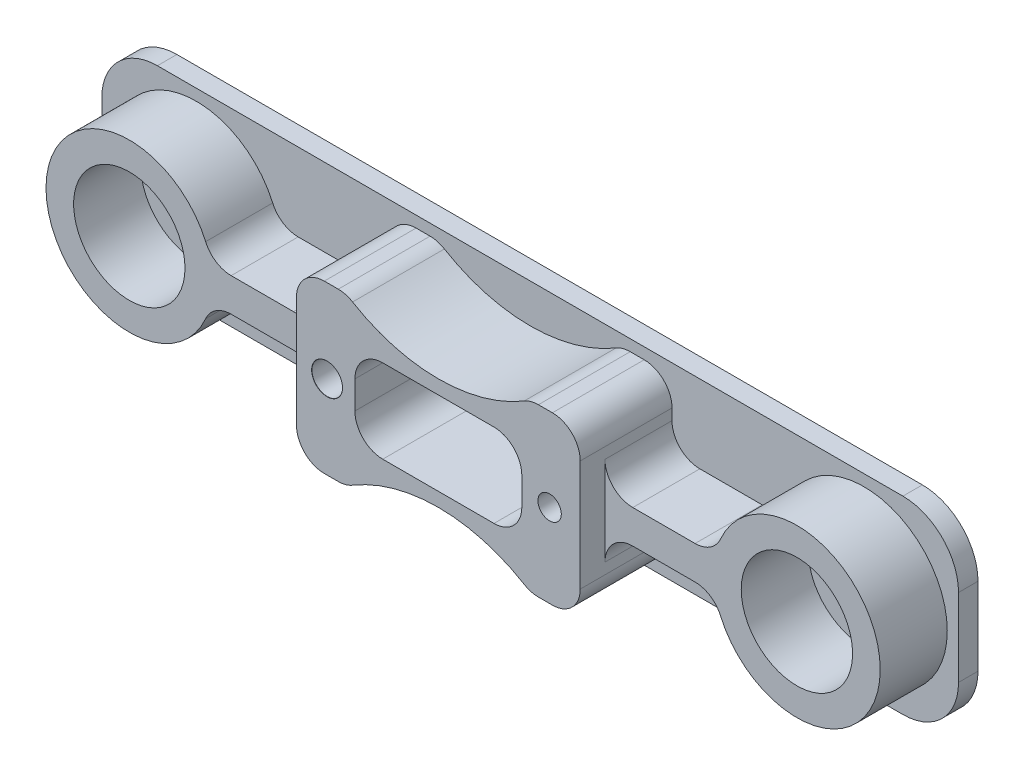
ISO-10303-21;
HEADER;
FILE_DESCRIPTION(('STEP AP214'),'2;1');
FILE_NAME('part.step','',(''),(''),'','','');
FILE_SCHEMA(('AUTOMOTIVE_DESIGN { 1 0 10303 214 1 1 1 1 }'));
ENDSEC;
DATA;
#1=APPLICATION_CONTEXT('core data for automotive mechanical design processes');
#2=APPLICATION_PROTOCOL_DEFINITION('international standard','automotive_design',2000,#1);
#3=PRODUCT_CONTEXT('',#1,'mechanical');
#4=PRODUCT('Part','Part','',(#3));
#5=PRODUCT_RELATED_PRODUCT_CATEGORY('part','',(#4));
#6=PRODUCT_DEFINITION_FORMATION('','',#4);
#7=PRODUCT_DEFINITION_CONTEXT('part definition',#1,'design');
#8=PRODUCT_DEFINITION('design','',#6,#7);
#9=PRODUCT_DEFINITION_SHAPE('','',#8);
#10=(LENGTH_UNIT() NAMED_UNIT(*) SI_UNIT(.MILLI.,.METRE.));
#11=(NAMED_UNIT(*) PLANE_ANGLE_UNIT() SI_UNIT($,.RADIAN.));
#12=(NAMED_UNIT(*) SI_UNIT($,.STERADIAN.) SOLID_ANGLE_UNIT());
#13=UNCERTAINTY_MEASURE_WITH_UNIT(LENGTH_MEASURE(1.E-05),#10,'distance_accuracy_value','');
#14=(GEOMETRIC_REPRESENTATION_CONTEXT(3) GLOBAL_UNCERTAINTY_ASSIGNED_CONTEXT((#13)) GLOBAL_UNIT_ASSIGNED_CONTEXT((#10,
#11,#12)) REPRESENTATION_CONTEXT('',''));
#15=CARTESIAN_POINT('',(0.,0.,0.));
#16=DIRECTION('',(0.,0.,1.));
#17=DIRECTION('',(1.,0.,0.));
#18=AXIS2_PLACEMENT_3D('',#15,#16,#17);
#19=CARTESIAN_POINT('',(67.,-7.,3.5));
#20=DIRECTION('',(0.,0.,1.));
#21=DIRECTION('',(1.,0.,0.));
#22=AXIS2_PLACEMENT_3D('',#19,#20,#21);
#23=PLANE('',#22);
#24=DIRECTION('',(-1.,0.,0.));
#25=VECTOR('',#24,1.);
#26=CARTESIAN_POINT('',(67.,17.,3.5));
#27=LINE('',#26,#25);
#28=CARTESIAN_POINT('',(67.,17.,3.5));
#29=VERTEX_POINT('',#28);
#30=CARTESIAN_POINT('',(-67.,17.,3.5));
#31=VERTEX_POINT('',#30);
#32=EDGE_CURVE('E565',#29,#31,#27,.T.);
#33=ORIENTED_EDGE('',*,*,#32,.T.);
#34=CARTESIAN_POINT('',(-67.,6.99999999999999,3.5));
#35=DIRECTION('',(0.,0.,1.));
#36=DIRECTION('',(1.,0.,0.));
#37=AXIS2_PLACEMENT_3D('',#34,#35,#36);
#38=CIRCLE('',#37,9.99999999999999);
#39=CARTESIAN_POINT('',(-77.,6.99999999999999,3.5));
#40=VERTEX_POINT('',#39);
#41=EDGE_CURVE('E567',#31,#40,#38,.T.);
#42=ORIENTED_EDGE('',*,*,#41,.T.);
#43=DIRECTION('',(0.,-1.,0.));
#44=VECTOR('',#43,1.);
#45=CARTESIAN_POINT('',(-77.,-7.00000000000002,3.5));
#46=LINE('',#45,#44);
#47=CARTESIAN_POINT('',(-77.,-7.00000000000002,3.5));
#48=VERTEX_POINT('',#47);
#49=EDGE_CURVE('E569',#40,#48,#46,.T.);
#50=ORIENTED_EDGE('',*,*,#49,.T.);
#51=CARTESIAN_POINT('',(-67.,-7.00000000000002,3.5));
#52=DIRECTION('',(0.,0.,1.));
#53=DIRECTION('',(-1.,0.,0.));
#54=AXIS2_PLACEMENT_3D('',#51,#52,#53);
#55=CIRCLE('',#54,9.99999999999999);
#56=CARTESIAN_POINT('',(-67.,-17.,3.5));
#57=VERTEX_POINT('',#56);
#58=EDGE_CURVE('E571',#48,#57,#55,.T.);
#59=ORIENTED_EDGE('',*,*,#58,.T.);
#60=DIRECTION('',(1.,0.,0.));
#61=VECTOR('',#60,1.);
#62=CARTESIAN_POINT('',(67.,-17.,3.5));
#63=LINE('',#62,#61);
#64=CARTESIAN_POINT('',(67.,-17.,3.5));
#65=VERTEX_POINT('',#64);
#66=EDGE_CURVE('E573',#57,#65,#63,.T.);
#67=ORIENTED_EDGE('',*,*,#66,.T.);
#68=CARTESIAN_POINT('',(67.,-7.,3.5));
#69=DIRECTION('',(0.,0.,1.));
#70=DIRECTION('',(1.,0.,0.));
#71=AXIS2_PLACEMENT_3D('',#68,#69,#70);
#72=CIRCLE('',#71,10.);
#73=CARTESIAN_POINT('',(77.,-7.,3.5));
#74=VERTEX_POINT('',#73);
#75=EDGE_CURVE('E557',#65,#74,#72,.T.);
#76=ORIENTED_EDGE('',*,*,#75,.T.);
#77=DIRECTION('',(0.,1.,0.));
#78=VECTOR('',#77,1.);
#79=CARTESIAN_POINT('',(77.,-7.,3.5));
#80=LINE('',#79,#78);
#81=CARTESIAN_POINT('',(77.,7.00000000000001,3.5));
#82=VERTEX_POINT('',#81);
#83=EDGE_CURVE('E560',#74,#82,#80,.T.);
#84=ORIENTED_EDGE('',*,*,#83,.T.);
#85=CARTESIAN_POINT('',(67.,7.00000000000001,3.5));
#86=DIRECTION('',(0.,0.,1.));
#87=DIRECTION('',(1.,0.,0.));
#88=AXIS2_PLACEMENT_3D('',#85,#86,#87);
#89=CIRCLE('',#88,10.);
#90=EDGE_CURVE('E563',#82,#29,#89,.T.);
#91=ORIENTED_EDGE('',*,*,#90,.T.);
#92=EDGE_LOOP('',(#33,#42,#50,#59,#67,#76,#84,#91));
#93=FACE_BOUND('',#92,.T.);
#94=CARTESIAN_POINT('',(60.,0.,3.5));
#95=DIRECTION('',(0.,0.,1.));
#96=DIRECTION('',(-1.,0.,0.));
#97=AXIS2_PLACEMENT_3D('',#94,#95,#96);
#98=CIRCLE('',#97,14.975);
#99=CARTESIAN_POINT('',(46.2784601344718,-5.99749687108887,3.5));
#100=VERTEX_POINT('',#99);
#101=CARTESIAN_POINT('',(46.2784601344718,5.99749687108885,3.5));
#102=VERTEX_POINT('',#101);
#103=EDGE_CURVE('E378',#100,#102,#98,.T.);
#104=ORIENTED_EDGE('',*,*,#103,.F.);
#105=CARTESIAN_POINT('',(41.6969777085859,-8.,3.5));
#106=DIRECTION('',(0.,0.,1.));
#107=DIRECTION('',(1.,0.,0.));
#108=AXIS2_PLACEMENT_3D('',#105,#106,#107);
#109=CIRCLE('',#108,5.);
#110=CARTESIAN_POINT('',(41.6969777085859,-3.,3.5));
#111=VERTEX_POINT('',#110);
#112=EDGE_CURVE('E675',#100,#111,#109,.T.);
#113=ORIENTED_EDGE('',*,*,#112,.T.);
#114=DIRECTION('',(1.,0.,0.));
#115=VECTOR('',#114,1.);
#116=CARTESIAN_POINT('',(25.5,-3.00000000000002,3.5));
#117=LINE('',#116,#115);
#118=CARTESIAN_POINT('',(30.5,-3.00000000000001,3.5));
#119=VERTEX_POINT('',#118);
#120=EDGE_CURVE('E382',#119,#111,#117,.T.);
#121=ORIENTED_EDGE('',*,*,#120,.F.);
#122=CARTESIAN_POINT('',(30.5,-8.00000000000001,3.5));
#123=DIRECTION('',(0.,0.,1.));
#124=DIRECTION('',(1.,0.,0.));
#125=AXIS2_PLACEMENT_3D('',#122,#123,#124);
#126=CIRCLE('',#125,5.);
#127=CARTESIAN_POINT('',(25.5,-8.00000000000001,3.5));
#128=VERTEX_POINT('',#127);
#129=EDGE_CURVE('E673',#119,#128,#126,.T.);
#130=ORIENTED_EDGE('',*,*,#129,.T.);
#131=DIRECTION('',(0.,1.,0.));
#132=VECTOR('',#131,1.);
#133=CARTESIAN_POINT('',(25.5,-9.975,3.5));
#134=LINE('',#133,#132);
#135=CARTESIAN_POINT('',(25.5,-9.975,3.5));
#136=VERTEX_POINT('',#135);
#137=EDGE_CURVE('E520',#136,#128,#134,.T.);
#138=ORIENTED_EDGE('',*,*,#137,.F.);
#139=CARTESIAN_POINT('',(20.5,-9.975,3.5));
#140=DIRECTION('',(0.,0.,1.));
#141=DIRECTION('',(1.,0.,0.));
#142=AXIS2_PLACEMENT_3D('',#139,#140,#141);
#143=CIRCLE('',#142,5.);
#144=CARTESIAN_POINT('',(20.5,-14.975,3.5));
#145=VERTEX_POINT('',#144);
#146=EDGE_CURVE('E517',#145,#136,#143,.T.);
#147=ORIENTED_EDGE('',*,*,#146,.F.);
#148=DIRECTION('',(1.,0.,0.));
#149=VECTOR('',#148,1.);
#150=CARTESIAN_POINT('',(-20.5,-14.975,3.5));
#151=LINE('',#150,#149);
#152=CARTESIAN_POINT('',(17.986088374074,-14.975,3.5));
#153=VERTEX_POINT('',#152);
#154=EDGE_CURVE('E513',#153,#145,#151,.T.);
#155=ORIENTED_EDGE('',*,*,#154,.F.);
#156=CARTESIAN_POINT('',(17.986088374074,-9.975,3.5));
#157=DIRECTION('',(0.,0.,1.));
#158=DIRECTION('',(1.,0.,0.));
#159=AXIS2_PLACEMENT_3D('',#156,#157,#158);
#160=CIRCLE('',#159,5.);
#161=CARTESIAN_POINT('',(15.4166471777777,-14.2642857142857,3.5));
#162=VERTEX_POINT('',#161);
#163=EDGE_CURVE('E648',#153,#162,#160,.F.);
#164=ORIENTED_EDGE('',*,*,#163,.T.);
#165=CARTESIAN_POINT('',(0.,-40.,3.5));
#166=DIRECTION('',(0.,0.,1.));
#167=DIRECTION('',(1.,0.,0.));
#168=AXIS2_PLACEMENT_3D('',#165,#166,#167);
#169=CIRCLE('',#168,30.);
#170=CARTESIAN_POINT('',(-15.4166471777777,-14.2642857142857,3.5));
#171=VERTEX_POINT('',#170);
#172=EDGE_CURVE('E427',#171,#162,#169,.F.);
#173=ORIENTED_EDGE('',*,*,#172,.F.);
#174=CARTESIAN_POINT('',(-17.986088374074,-9.975,3.5));
#175=DIRECTION('',(0.,0.,1.));
#176=DIRECTION('',(1.,0.,0.));
#177=AXIS2_PLACEMENT_3D('',#174,#175,#176);
#178=CIRCLE('',#177,5.);
#179=CARTESIAN_POINT('',(-17.986088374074,-14.975,3.5));
#180=VERTEX_POINT('',#179);
#181=EDGE_CURVE('E646',#171,#180,#178,.F.);
#182=ORIENTED_EDGE('',*,*,#181,.T.);
#183=CARTESIAN_POINT('',(-20.5,-14.975,3.5));
#184=VERTEX_POINT('',#183);
#185=EDGE_CURVE('E514',#184,#180,#151,.T.);
#186=ORIENTED_EDGE('',*,*,#185,.F.);
#187=CARTESIAN_POINT('',(-20.5,-9.975,3.5));
#188=DIRECTION('',(0.,0.,1.));
#189=DIRECTION('',(-1.,0.,0.));
#190=AXIS2_PLACEMENT_3D('',#187,#188,#189);
#191=CIRCLE('',#190,5.);
#192=CARTESIAN_POINT('',(-25.5,-9.975,3.5));
#193=VERTEX_POINT('',#192);
#194=EDGE_CURVE('E487',#193,#184,#191,.T.);
#195=ORIENTED_EDGE('',*,*,#194,.F.);
#196=DIRECTION('',(0.,-1.,0.));
#197=VECTOR('',#196,1.);
#198=CARTESIAN_POINT('',(-25.5,-9.975,3.5));
#199=LINE('',#198,#197);
#200=CARTESIAN_POINT('',(-25.5,-8.,3.5));
#201=VERTEX_POINT('',#200);
#202=EDGE_CURVE('E532',#201,#193,#199,.T.);
#203=ORIENTED_EDGE('',*,*,#202,.F.);
#204=CARTESIAN_POINT('',(-30.5,-8.,3.5));
#205=DIRECTION('',(0.,0.,1.));
#206=DIRECTION('',(1.,0.,0.));
#207=AXIS2_PLACEMENT_3D('',#204,#205,#206);
#208=CIRCLE('',#207,5.);
#209=CARTESIAN_POINT('',(-30.5,-3.,3.5));
#210=VERTEX_POINT('',#209);
#211=EDGE_CURVE('E669',#201,#210,#208,.T.);
#212=ORIENTED_EDGE('',*,*,#211,.T.);
#213=DIRECTION('',(1.,0.,0.));
#214=VECTOR('',#213,1.);
#215=CARTESIAN_POINT('',(-25.5,-3.,3.5));
#216=LINE('',#215,#214);
#217=CARTESIAN_POINT('',(-41.6969777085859,-3.,3.5));
#218=VERTEX_POINT('',#217);
#219=EDGE_CURVE('E402',#218,#210,#216,.T.);
#220=ORIENTED_EDGE('',*,*,#219,.F.);
#221=CARTESIAN_POINT('',(-41.6969777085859,-8.,3.5));
#222=DIRECTION('',(0.,0.,1.));
#223=DIRECTION('',(1.,0.,0.));
#224=AXIS2_PLACEMENT_3D('',#221,#222,#223);
#225=CIRCLE('',#224,5.);
#226=CARTESIAN_POINT('',(-46.2784601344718,-5.99749687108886,3.5));
#227=VERTEX_POINT('',#226);
#228=EDGE_CURVE('E671',#218,#227,#225,.T.);
#229=ORIENTED_EDGE('',*,*,#228,.T.);
#230=CARTESIAN_POINT('',(-60.,0.,3.5));
#231=DIRECTION('',(0.,0.,1.));
#232=DIRECTION('',(1.,0.,0.));
#233=AXIS2_PLACEMENT_3D('',#230,#231,#232);
#234=CIRCLE('',#233,14.975);
#235=CARTESIAN_POINT('',(-46.2784601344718,5.99749687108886,3.5));
#236=VERTEX_POINT('',#235);
#237=EDGE_CURVE('E414',#236,#227,#234,.T.);
#238=ORIENTED_EDGE('',*,*,#237,.F.);
#239=CARTESIAN_POINT('',(-41.6969777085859,8.,3.5));
#240=DIRECTION('',(0.,0.,1.));
#241=DIRECTION('',(1.,0.,0.));
#242=AXIS2_PLACEMENT_3D('',#239,#240,#241);
#243=CIRCLE('',#242,5.);
#244=CARTESIAN_POINT('',(-41.6969777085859,3.,3.5));
#245=VERTEX_POINT('',#244);
#246=EDGE_CURVE('E661',#236,#245,#243,.T.);
#247=ORIENTED_EDGE('',*,*,#246,.T.);
#248=DIRECTION('',(-1.,0.,0.));
#249=VECTOR('',#248,1.);
#250=CARTESIAN_POINT('',(-25.5,3.,3.5));
#251=LINE('',#250,#249);
#252=CARTESIAN_POINT('',(-30.5,3.,3.5));
#253=VERTEX_POINT('',#252);
#254=EDGE_CURVE('E398',#253,#245,#251,.T.);
#255=ORIENTED_EDGE('',*,*,#254,.F.);
#256=CARTESIAN_POINT('',(-30.5,8.,3.5));
#257=DIRECTION('',(0.,0.,1.));
#258=DIRECTION('',(1.,0.,0.));
#259=AXIS2_PLACEMENT_3D('',#256,#257,#258);
#260=CIRCLE('',#259,5.);
#261=CARTESIAN_POINT('',(-25.5,8.,3.5));
#262=VERTEX_POINT('',#261);
#263=EDGE_CURVE('E667',#253,#262,#260,.T.);
#264=ORIENTED_EDGE('',*,*,#263,.T.);
#265=CARTESIAN_POINT('',(-25.5,9.97499999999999,3.5));
#266=VERTEX_POINT('',#265);
#267=EDGE_CURVE('E492',#266,#262,#199,.T.);
#268=ORIENTED_EDGE('',*,*,#267,.F.);
#269=CARTESIAN_POINT('',(-20.5,9.975,3.5));
#270=DIRECTION('',(0.,0.,1.));
#271=DIRECTION('',(-1.,0.,0.));
#272=AXIS2_PLACEMENT_3D('',#269,#270,#271);
#273=CIRCLE('',#272,5.);
#274=CARTESIAN_POINT('',(-20.5,14.975,3.5));
#275=VERTEX_POINT('',#274);
#276=EDGE_CURVE('E529',#275,#266,#273,.T.);
#277=ORIENTED_EDGE('',*,*,#276,.F.);
#278=DIRECTION('',(-1.,0.,0.));
#279=VECTOR('',#278,1.);
#280=CARTESIAN_POINT('',(-20.5,14.975,3.5));
#281=LINE('',#280,#279);
#282=CARTESIAN_POINT('',(-17.986088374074,14.975,3.5));
#283=VERTEX_POINT('',#282);
#284=EDGE_CURVE('E525',#283,#275,#281,.T.);
#285=ORIENTED_EDGE('',*,*,#284,.F.);
#286=CARTESIAN_POINT('',(-17.986088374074,9.975,3.5));
#287=DIRECTION('',(0.,0.,1.));
#288=DIRECTION('',(1.,0.,0.));
#289=AXIS2_PLACEMENT_3D('',#286,#287,#288);
#290=CIRCLE('',#289,5.);
#291=CARTESIAN_POINT('',(-15.4166471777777,14.2642857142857,3.5));
#292=VERTEX_POINT('',#291);
#293=EDGE_CURVE('E644',#283,#292,#290,.F.);
#294=ORIENTED_EDGE('',*,*,#293,.T.);
#295=CARTESIAN_POINT('',(0.,40.,3.5));
#296=DIRECTION('',(0.,0.,1.));
#297=DIRECTION('',(1.,0.,0.));
#298=AXIS2_PLACEMENT_3D('',#295,#296,#297);
#299=CIRCLE('',#298,30.);
#300=CARTESIAN_POINT('',(15.4166471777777,14.2642857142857,3.5));
#301=VERTEX_POINT('',#300);
#302=EDGE_CURVE('E421',#301,#292,#299,.F.);
#303=ORIENTED_EDGE('',*,*,#302,.F.);
#304=CARTESIAN_POINT('',(17.986088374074,9.975,3.5));
#305=DIRECTION('',(0.,0.,1.));
#306=DIRECTION('',(1.,0.,0.));
#307=AXIS2_PLACEMENT_3D('',#304,#305,#306);
#308=CIRCLE('',#307,5.);
#309=CARTESIAN_POINT('',(17.986088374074,14.975,3.5));
#310=VERTEX_POINT('',#309);
#311=EDGE_CURVE('E642',#301,#310,#308,.F.);
#312=ORIENTED_EDGE('',*,*,#311,.T.);
#313=CARTESIAN_POINT('',(20.5,14.975,3.5));
#314=VERTEX_POINT('',#313);
#315=EDGE_CURVE('E526',#314,#310,#281,.T.);
#316=ORIENTED_EDGE('',*,*,#315,.F.);
#317=CARTESIAN_POINT('',(20.5,9.975,3.5));
#318=DIRECTION('',(0.,0.,1.));
#319=DIRECTION('',(-1.,0.,0.));
#320=AXIS2_PLACEMENT_3D('',#317,#318,#319);
#321=CIRCLE('',#320,5.);
#322=CARTESIAN_POINT('',(25.5,9.975,3.5));
#323=VERTEX_POINT('',#322);
#324=EDGE_CURVE('E523',#323,#314,#321,.T.);
#325=ORIENTED_EDGE('',*,*,#324,.F.);
#326=CARTESIAN_POINT('',(25.5,7.99999999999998,3.5));
#327=VERTEX_POINT('',#326);
#328=EDGE_CURVE('E519',#327,#323,#134,.T.);
#329=ORIENTED_EDGE('',*,*,#328,.F.);
#330=CARTESIAN_POINT('',(30.5,7.99999999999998,3.5));
#331=DIRECTION('',(0.,0.,1.));
#332=DIRECTION('',(1.,0.,0.));
#333=AXIS2_PLACEMENT_3D('',#330,#331,#332);
#334=CIRCLE('',#333,5.);
#335=CARTESIAN_POINT('',(30.5,2.99999999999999,3.5));
#336=VERTEX_POINT('',#335);
#337=EDGE_CURVE('E663',#327,#336,#334,.T.);
#338=ORIENTED_EDGE('',*,*,#337,.T.);
#339=DIRECTION('',(-1.,0.,0.));
#340=VECTOR('',#339,1.);
#341=CARTESIAN_POINT('',(25.5,2.99999999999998,3.5));
#342=LINE('',#341,#340);
#343=CARTESIAN_POINT('',(41.696977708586,3.,3.5));
#344=VERTEX_POINT('',#343);
#345=EDGE_CURVE('E392',#344,#336,#342,.T.);
#346=ORIENTED_EDGE('',*,*,#345,.F.);
#347=CARTESIAN_POINT('',(41.696977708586,8.,3.5));
#348=DIRECTION('',(0.,0.,1.));
#349=DIRECTION('',(1.,0.,0.));
#350=AXIS2_PLACEMENT_3D('',#347,#348,#349);
#351=CIRCLE('',#350,5.);
#352=EDGE_CURVE('E665',#344,#102,#351,.T.);
#353=ORIENTED_EDGE('',*,*,#352,.T.);
#354=EDGE_LOOP('',(#104,#113,#121,#130,#138,#147,#155,#164,#173,#182,#186,#195,#203,#212,#220,
#229,#238,#247,#255,#264,#268,#277,#285,#294,#303,#312,#316,#325,#329,#338,#346,#353));
#355=FACE_BOUND('',#354,.T.);
#356=ADVANCED_FACE('F38',(#93,#355),#23,.T.);
#357=CARTESIAN_POINT('',(25.5,-9.975,20.));
#358=DIRECTION('',(-1.,0.,0.));
#359=DIRECTION('',(0.,0.,1.));
#360=AXIS2_PLACEMENT_3D('',#357,#358,#359);
#361=PLANE('',#360);
#362=ORIENTED_EDGE('',*,*,#137,.T.);
#363=DIRECTION('',(0.,0.,-1.));
#364=VECTOR('',#363,1.);
#365=CARTESIAN_POINT('',(25.5,-8.00000000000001,15.55));
#366=LINE('',#365,#364);
#367=CARTESIAN_POINT('',(25.5,-8.00000000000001,15.55));
#368=VERTEX_POINT('',#367);
#369=EDGE_CURVE('E685',#128,#368,#366,.F.);
#370=ORIENTED_EDGE('',*,*,#369,.T.);
#371=DIRECTION('',(0.,-1.,0.));
#372=VECTOR('',#371,1.);
#373=CARTESIAN_POINT('',(25.5,2.99999999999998,15.55));
#374=LINE('',#373,#372);
#375=CARTESIAN_POINT('',(25.5,7.99999999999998,15.55));
#376=VERTEX_POINT('',#375);
#377=EDGE_CURVE('E384',#376,#368,#374,.T.);
#378=ORIENTED_EDGE('',*,*,#377,.F.);
#379=DIRECTION('',(0.,0.,-1.));
#380=VECTOR('',#379,1.);
#381=CARTESIAN_POINT('',(25.5,7.99999999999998,3.5));
#382=LINE('',#381,#380);
#383=EDGE_CURVE('E682',#376,#327,#382,.T.);
#384=ORIENTED_EDGE('',*,*,#383,.T.);
#385=ORIENTED_EDGE('',*,*,#328,.T.);
#386=DIRECTION('',(0.,0.,-1.));
#387=VECTOR('',#386,1.);
#388=CARTESIAN_POINT('',(25.5,9.975,20.));
#389=LINE('',#388,#387);
#390=CARTESIAN_POINT('',(25.5,9.975,20.));
#391=VERTEX_POINT('',#390);
#392=EDGE_CURVE('E545',#391,#323,#389,.T.);
#393=ORIENTED_EDGE('',*,*,#392,.F.);
#394=DIRECTION('',(0.,1.,0.));
#395=VECTOR('',#394,1.);
#396=CARTESIAN_POINT('',(25.5,-9.975,20.));
#397=LINE('',#396,#395);
#398=CARTESIAN_POINT('',(25.5,-9.975,20.));
#399=VERTEX_POINT('',#398);
#400=EDGE_CURVE('E498',#399,#391,#397,.T.);
#401=ORIENTED_EDGE('',*,*,#400,.F.);
#402=DIRECTION('',(0.,0.,-1.));
#403=VECTOR('',#402,1.);
#404=CARTESIAN_POINT('',(25.5,-9.975,20.));
#405=LINE('',#404,#403);
#406=EDGE_CURVE('E548',#399,#136,#405,.T.);
#407=ORIENTED_EDGE('',*,*,#406,.T.);
#408=EDGE_LOOP('',(#362,#370,#378,#384,#385,#393,#401,#407));
#409=FACE_BOUND('',#408,.T.);
#410=ADVANCED_FACE('F733',(#409),#361,.F.);
#411=CARTESIAN_POINT('',(-25.5,-9.975,20.));
#412=DIRECTION('',(1.,0.,0.));
#413=DIRECTION('',(0.,0.,-1.));
#414=AXIS2_PLACEMENT_3D('',#411,#412,#413);
#415=PLANE('',#414);
#416=DIRECTION('',(0.,1.,0.));
#417=VECTOR('',#416,1.);
#418=CARTESIAN_POINT('',(-25.5,3.,15.55));
#419=LINE('',#418,#417);
#420=CARTESIAN_POINT('',(-25.5,-8.,15.55));
#421=VERTEX_POINT('',#420);
#422=CARTESIAN_POINT('',(-25.5,8.,15.55));
#423=VERTEX_POINT('',#422);
#424=EDGE_CURVE('E399',#421,#423,#419,.T.);
#425=ORIENTED_EDGE('',*,*,#424,.F.);
#426=DIRECTION('',(0.,0.,-1.));
#427=VECTOR('',#426,1.);
#428=CARTESIAN_POINT('',(-25.5,-8.,3.5));
#429=LINE('',#428,#427);
#430=EDGE_CURVE('E701',#421,#201,#429,.T.);
#431=ORIENTED_EDGE('',*,*,#430,.T.);
#432=ORIENTED_EDGE('',*,*,#202,.T.);
#433=DIRECTION('',(0.,0.,-1.));
#434=VECTOR('',#433,1.);
#435=CARTESIAN_POINT('',(-25.5,-9.975,20.));
#436=LINE('',#435,#434);
#437=CARTESIAN_POINT('',(-25.5,-9.975,20.));
#438=VERTEX_POINT('',#437);
#439=EDGE_CURVE('E510',#438,#193,#436,.T.);
#440=ORIENTED_EDGE('',*,*,#439,.F.);
#441=DIRECTION('',(0.,-1.,0.));
#442=VECTOR('',#441,1.);
#443=CARTESIAN_POINT('',(-25.5,-9.975,20.));
#444=LINE('',#443,#442);
#445=CARTESIAN_POINT('',(-25.5,9.975,20.));
#446=VERTEX_POINT('',#445);
#447=EDGE_CURVE('E508',#446,#438,#444,.T.);
#448=ORIENTED_EDGE('',*,*,#447,.F.);
#449=DIRECTION('',(0.,0.,-1.));
#450=VECTOR('',#449,1.);
#451=CARTESIAN_POINT('',(-25.5,9.975,20.));
#452=LINE('',#451,#450);
#453=EDGE_CURVE('E537',#446,#266,#452,.T.);
#454=ORIENTED_EDGE('',*,*,#453,.T.);
#455=ORIENTED_EDGE('',*,*,#267,.T.);
#456=DIRECTION('',(0.,0.,-1.));
#457=VECTOR('',#456,1.);
#458=CARTESIAN_POINT('',(-25.5,8.,15.55));
#459=LINE('',#458,#457);
#460=EDGE_CURVE('E698',#262,#423,#459,.F.);
#461=ORIENTED_EDGE('',*,*,#460,.T.);
#462=EDGE_LOOP('',(#425,#431,#432,#440,#448,#454,#455,#461));
#463=FACE_BOUND('',#462,.T.);
#464=ADVANCED_FACE('F798',(#463),#415,.F.);
#465=CARTESIAN_POINT('',(-20.5,14.975,20.));
#466=DIRECTION('',(0.,-1.,0.));
#467=DIRECTION('',(1.,0.,0.));
#468=AXIS2_PLACEMENT_3D('',#465,#466,#467);
#469=PLANE('',#468);
#470=ORIENTED_EDGE('',*,*,#315,.T.);
#471=DIRECTION('',(0.,0.,1.));
#472=VECTOR('',#471,1.);
#473=CARTESIAN_POINT('',(17.986088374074,14.975,20.));
#474=LINE('',#473,#472);
#475=CARTESIAN_POINT('',(17.986088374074,14.975,20.));
#476=VERTEX_POINT('',#475);
#477=EDGE_CURVE('E614',#310,#476,#474,.T.);
#478=ORIENTED_EDGE('',*,*,#477,.T.);
#479=DIRECTION('',(-1.,0.,0.));
#480=VECTOR('',#479,1.);
#481=CARTESIAN_POINT('',(-20.5,14.975,20.));
#482=LINE('',#481,#480);
#483=CARTESIAN_POINT('',(20.5,14.975,20.));
#484=VERTEX_POINT('',#483);
#485=EDGE_CURVE('E503',#484,#476,#482,.T.);
#486=ORIENTED_EDGE('',*,*,#485,.F.);
#487=DIRECTION('',(0.,0.,-1.));
#488=VECTOR('',#487,1.);
#489=CARTESIAN_POINT('',(20.5,14.975,20.));
#490=LINE('',#489,#488);
#491=EDGE_CURVE('E542',#484,#314,#490,.T.);
#492=ORIENTED_EDGE('',*,*,#491,.T.);
#493=EDGE_LOOP('',(#470,#478,#486,#492));
#494=FACE_BOUND('',#493,.T.);
#495=ADVANCED_FACE('F746',(#494),#469,.F.);
#496=CARTESIAN_POINT('',(-20.5,-14.975,20.));
#497=DIRECTION('',(0.,1.,0.));
#498=DIRECTION('',(0.,0.,1.));
#499=AXIS2_PLACEMENT_3D('',#496,#497,#498);
#500=PLANE('',#499);
#501=ORIENTED_EDGE('',*,*,#185,.T.);
#502=DIRECTION('',(0.,0.,1.));
#503=VECTOR('',#502,1.);
#504=CARTESIAN_POINT('',(-17.986088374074,-14.975,20.));
#505=LINE('',#504,#503);
#506=CARTESIAN_POINT('',(-17.986088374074,-14.975,20.));
#507=VERTEX_POINT('',#506);
#508=EDGE_CURVE('E632',#180,#507,#505,.T.);
#509=ORIENTED_EDGE('',*,*,#508,.T.);
#510=DIRECTION('',(1.,0.,0.));
#511=VECTOR('',#510,1.);
#512=CARTESIAN_POINT('',(-20.5,-14.975,20.));
#513=LINE('',#512,#511);
#514=CARTESIAN_POINT('',(-20.5,-14.975,20.));
#515=VERTEX_POINT('',#514);
#516=EDGE_CURVE('E493',#515,#507,#513,.T.);
#517=ORIENTED_EDGE('',*,*,#516,.F.);
#518=DIRECTION('',(0.,0.,-1.));
#519=VECTOR('',#518,1.);
#520=CARTESIAN_POINT('',(-20.5,-14.975,20.));
#521=LINE('',#520,#519);
#522=EDGE_CURVE('E554',#515,#184,#521,.T.);
#523=ORIENTED_EDGE('',*,*,#522,.T.);
#524=EDGE_LOOP('',(#501,#509,#517,#523));
#525=FACE_BOUND('',#524,.T.);
#526=ADVANCED_FACE('F906',(#525),#500,.F.);
#527=CARTESIAN_POINT('',(67.,-7.,3.5));
#528=DIRECTION('',(0.,0.,-1.));
#529=DIRECTION('',(-1.,0.,0.));
#530=AXIS2_PLACEMENT_3D('',#527,#528,#529);
#531=CYLINDRICAL_SURFACE('',#530,10.);
#532=CARTESIAN_POINT('',(67.,-7.,0.));
#533=DIRECTION('',(0.,0.,1.));
#534=DIRECTION('',(1.,0.,0.));
#535=AXIS2_PLACEMENT_3D('',#532,#533,#534);
#536=CIRCLE('',#535,10.);
#537=CARTESIAN_POINT('',(67.,-17.,0.));
#538=VERTEX_POINT('',#537);
#539=CARTESIAN_POINT('',(77.,-7.,0.));
#540=VERTEX_POINT('',#539);
#541=EDGE_CURVE('E556',#538,#540,#536,.T.);
#542=ORIENTED_EDGE('',*,*,#541,.T.);
#543=DIRECTION('',(0.,0.,-1.));
#544=VECTOR('',#543,1.);
#545=CARTESIAN_POINT('',(77.,-7.,3.5));
#546=LINE('',#545,#544);
#547=EDGE_CURVE('E611',#74,#540,#546,.T.);
#548=ORIENTED_EDGE('',*,*,#547,.F.);
#549=ORIENTED_EDGE('',*,*,#75,.F.);
#550=DIRECTION('',(0.,0.,-1.));
#551=VECTOR('',#550,1.);
#552=CARTESIAN_POINT('',(67.,-17.,3.5));
#553=LINE('',#552,#551);
#554=EDGE_CURVE('E575',#65,#538,#553,.T.);
#555=ORIENTED_EDGE('',*,*,#554,.T.);
#556=EDGE_LOOP('',(#542,#548,#549,#555));
#557=FACE_BOUND('',#556,.T.);
#558=ADVANCED_FACE('F1010',(#557),#531,.T.);
#559=CARTESIAN_POINT('',(77.,-7.,3.5));
#560=DIRECTION('',(-1.,0.,0.));
#561=DIRECTION('',(0.,0.,1.));
#562=AXIS2_PLACEMENT_3D('',#559,#560,#561);
#563=PLANE('',#562);
#564=DIRECTION('',(0.,1.,0.));
#565=VECTOR('',#564,1.);
#566=CARTESIAN_POINT('',(77.,-7.,0.));
#567=LINE('',#566,#565);
#568=CARTESIAN_POINT('',(77.,7.00000000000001,0.));
#569=VERTEX_POINT('',#568);
#570=EDGE_CURVE('E578',#540,#569,#567,.T.);
#571=ORIENTED_EDGE('',*,*,#570,.T.);
#572=DIRECTION('',(0.,0.,-1.));
#573=VECTOR('',#572,1.);
#574=CARTESIAN_POINT('',(77.,7.00000000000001,3.5));
#575=LINE('',#574,#573);
#576=EDGE_CURVE('E608',#82,#569,#575,.T.);
#577=ORIENTED_EDGE('',*,*,#576,.F.);
#578=ORIENTED_EDGE('',*,*,#83,.F.);
#579=ORIENTED_EDGE('',*,*,#547,.T.);
#580=EDGE_LOOP('',(#571,#577,#578,#579));
#581=FACE_BOUND('',#580,.T.);
#582=ADVANCED_FACE('F1013',(#581),#563,.F.);
#583=CARTESIAN_POINT('',(67.,7.00000000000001,3.5));
#584=DIRECTION('',(0.,0.,-1.));
#585=DIRECTION('',(-1.,0.,0.));
#586=AXIS2_PLACEMENT_3D('',#583,#584,#585);
#587=CYLINDRICAL_SURFACE('',#586,10.);
#588=CARTESIAN_POINT('',(67.,7.00000000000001,0.));
#589=DIRECTION('',(0.,0.,1.));
#590=DIRECTION('',(1.,0.,0.));
#591=AXIS2_PLACEMENT_3D('',#588,#589,#590);
#592=CIRCLE('',#591,10.);
#593=CARTESIAN_POINT('',(67.,17.,0.));
#594=VERTEX_POINT('',#593);
#595=EDGE_CURVE('E580',#569,#594,#592,.T.);
#596=ORIENTED_EDGE('',*,*,#595,.T.);
#597=DIRECTION('',(0.,0.,-1.));
#598=VECTOR('',#597,1.);
#599=CARTESIAN_POINT('',(67.,17.,3.5));
#600=LINE('',#599,#598);
#601=EDGE_CURVE('E605',#29,#594,#600,.T.);
#602=ORIENTED_EDGE('',*,*,#601,.F.);
#603=ORIENTED_EDGE('',*,*,#90,.F.);
#604=ORIENTED_EDGE('',*,*,#576,.T.);
#605=EDGE_LOOP('',(#596,#602,#603,#604));
#606=FACE_BOUND('',#605,.T.);
#607=ADVANCED_FACE('F1017',(#606),#587,.T.);
#608=CARTESIAN_POINT('',(67.,17.,3.5));
#609=DIRECTION('',(0.,-1.,0.));
#610=DIRECTION('',(1.,0.,0.));
#611=AXIS2_PLACEMENT_3D('',#608,#609,#610);
#612=PLANE('',#611);
#613=DIRECTION('',(-1.,0.,0.));
#614=VECTOR('',#613,1.);
#615=CARTESIAN_POINT('',(67.,17.,0.));
#616=LINE('',#615,#614);
#617=CARTESIAN_POINT('',(-67.,17.,0.));
#618=VERTEX_POINT('',#617);
#619=EDGE_CURVE('E582',#594,#618,#616,.T.);
#620=ORIENTED_EDGE('',*,*,#619,.T.);
#621=DIRECTION('',(0.,0.,-1.));
#622=VECTOR('',#621,1.);
#623=CARTESIAN_POINT('',(-67.,17.,3.5));
#624=LINE('',#623,#622);
#625=EDGE_CURVE('E602',#31,#618,#624,.T.);
#626=ORIENTED_EDGE('',*,*,#625,.F.);
#627=ORIENTED_EDGE('',*,*,#32,.F.);
#628=ORIENTED_EDGE('',*,*,#601,.T.);
#629=EDGE_LOOP('',(#620,#626,#627,#628));
#630=FACE_BOUND('',#629,.T.);
#631=ADVANCED_FACE('F1021',(#630),#612,.F.);
#632=CARTESIAN_POINT('',(-67.,6.99999999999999,3.5));
#633=DIRECTION('',(0.,0.,-1.));
#634=DIRECTION('',(-1.,0.,0.));
#635=AXIS2_PLACEMENT_3D('',#632,#633,#634);
#636=CYLINDRICAL_SURFACE('',#635,9.99999999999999);
#637=CARTESIAN_POINT('',(-67.,6.99999999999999,0.));
#638=DIRECTION('',(0.,0.,1.));
#639=DIRECTION('',(1.,0.,0.));
#640=AXIS2_PLACEMENT_3D('',#637,#638,#639);
#641=CIRCLE('',#640,9.99999999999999);
#642=CARTESIAN_POINT('',(-77.,6.99999999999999,0.));
#643=VERTEX_POINT('',#642);
#644=EDGE_CURVE('E584',#618,#643,#641,.T.);
#645=ORIENTED_EDGE('',*,*,#644,.T.);
#646=DIRECTION('',(0.,0.,-1.));
#647=VECTOR('',#646,1.);
#648=CARTESIAN_POINT('',(-77.,6.99999999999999,3.5));
#649=LINE('',#648,#647);
#650=EDGE_CURVE('E599',#40,#643,#649,.T.);
#651=ORIENTED_EDGE('',*,*,#650,.F.);
#652=ORIENTED_EDGE('',*,*,#41,.F.);
#653=ORIENTED_EDGE('',*,*,#625,.T.);
#654=EDGE_LOOP('',(#645,#651,#652,#653));
#655=FACE_BOUND('',#654,.T.);
#656=ADVANCED_FACE('F1025',(#655),#636,.T.);
#657=CARTESIAN_POINT('',(-77.,-7.00000000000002,3.5));
#658=DIRECTION('',(1.,0.,0.));
#659=DIRECTION('',(0.,1.,0.));
#660=AXIS2_PLACEMENT_3D('',#657,#658,#659);
#661=PLANE('',#660);
#662=DIRECTION('',(0.,-1.,0.));
#663=VECTOR('',#662,1.);
#664=CARTESIAN_POINT('',(-77.,-7.00000000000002,0.));
#665=LINE('',#664,#663);
#666=CARTESIAN_POINT('',(-77.,-7.00000000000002,0.));
#667=VERTEX_POINT('',#666);
#668=EDGE_CURVE('E586',#643,#667,#665,.T.);
#669=ORIENTED_EDGE('',*,*,#668,.T.);
#670=DIRECTION('',(0.,0.,-1.));
#671=VECTOR('',#670,1.);
#672=CARTESIAN_POINT('',(-77.,-7.00000000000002,3.5));
#673=LINE('',#672,#671);
#674=EDGE_CURVE('E596',#48,#667,#673,.T.);
#675=ORIENTED_EDGE('',*,*,#674,.F.);
#676=ORIENTED_EDGE('',*,*,#49,.F.);
#677=ORIENTED_EDGE('',*,*,#650,.T.);
#678=EDGE_LOOP('',(#669,#675,#676,#677));
#679=FACE_BOUND('',#678,.T.);
#680=ADVANCED_FACE('F1029',(#679),#661,.F.);
#681=CARTESIAN_POINT('',(-67.,-7.00000000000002,3.5));
#682=DIRECTION('',(0.,0.,-1.));
#683=DIRECTION('',(-1.,0.,0.));
#684=AXIS2_PLACEMENT_3D('',#681,#682,#683);
#685=CYLINDRICAL_SURFACE('',#684,9.99999999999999);
#686=CARTESIAN_POINT('',(-67.,-7.00000000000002,0.));
#687=DIRECTION('',(0.,0.,1.));
#688=DIRECTION('',(-1.,0.,0.));
#689=AXIS2_PLACEMENT_3D('',#686,#687,#688);
#690=CIRCLE('',#689,9.99999999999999);
#691=CARTESIAN_POINT('',(-67.,-17.,0.));
#692=VERTEX_POINT('',#691);
#693=EDGE_CURVE('E588',#667,#692,#690,.T.);
#694=ORIENTED_EDGE('',*,*,#693,.T.);
#695=DIRECTION('',(0.,0.,-1.));
#696=VECTOR('',#695,1.);
#697=CARTESIAN_POINT('',(-67.,-17.,3.5));
#698=LINE('',#697,#696);
#699=EDGE_CURVE('E593',#57,#692,#698,.T.);
#700=ORIENTED_EDGE('',*,*,#699,.F.);
#701=ORIENTED_EDGE('',*,*,#58,.F.);
#702=ORIENTED_EDGE('',*,*,#674,.T.);
#703=EDGE_LOOP('',(#694,#700,#701,#702));
#704=FACE_BOUND('',#703,.T.);
#705=ADVANCED_FACE('F1033',(#704),#685,.T.);
#706=CARTESIAN_POINT('',(67.,-17.,3.5));
#707=DIRECTION('',(0.,1.,0.));
#708=DIRECTION('',(-1.,0.,0.));
#709=AXIS2_PLACEMENT_3D('',#706,#707,#708);
#710=PLANE('',#709);
#711=DIRECTION('',(1.,0.,0.));
#712=VECTOR('',#711,1.);
#713=CARTESIAN_POINT('',(67.,-17.,0.));
#714=LINE('',#713,#712);
#715=EDGE_CURVE('E561',#692,#538,#714,.T.);
#716=ORIENTED_EDGE('',*,*,#715,.T.);
#717=ORIENTED_EDGE('',*,*,#554,.F.);
#718=ORIENTED_EDGE('',*,*,#66,.F.);
#719=ORIENTED_EDGE('',*,*,#699,.T.);
#720=EDGE_LOOP('',(#716,#717,#718,#719));
#721=FACE_BOUND('',#720,.T.);
#722=ADVANCED_FACE('F1037',(#721),#710,.F.);
#723=CARTESIAN_POINT('',(67.,-7.,0.));
#724=DIRECTION('',(0.,0.,1.));
#725=DIRECTION('',(1.,0.,0.));
#726=AXIS2_PLACEMENT_3D('',#723,#724,#725);
#727=PLANE('',#726);
#728=CARTESIAN_POINT('',(-20.,0.,0.));
#729=DIRECTION('',(0.,0.,-1.));
#730=DIRECTION('',(-1.,0.,0.));
#731=AXIS2_PLACEMENT_3D('',#728,#729,#730);
#732=CIRCLE('',#731,5.2);
#733=CARTESIAN_POINT('',(-25.2,0.,0.));
#734=VERTEX_POINT('',#733);
#735=EDGE_CURVE('E359',#734,#734,#732,.T.);
#736=ORIENTED_EDGE('',*,*,#735,.F.);
#737=EDGE_LOOP('',(#736));
#738=FACE_BOUND('',#737,.T.);
#739=ORIENTED_EDGE('',*,*,#541,.F.);
#740=ORIENTED_EDGE('',*,*,#715,.F.);
#741=ORIENTED_EDGE('',*,*,#693,.F.);
#742=ORIENTED_EDGE('',*,*,#668,.F.);
#743=ORIENTED_EDGE('',*,*,#644,.F.);
#744=ORIENTED_EDGE('',*,*,#619,.F.);
#745=ORIENTED_EDGE('',*,*,#595,.F.);
#746=ORIENTED_EDGE('',*,*,#570,.F.);
#747=EDGE_LOOP('',(#739,#740,#741,#742,#743,#744,#745,#746));
#748=FACE_BOUND('',#747,.T.);
#749=ADVANCED_FACE('F886',(#738,#748),#727,.F.);
#750=CARTESIAN_POINT('',(-20.5,-9.975,20.));
#751=DIRECTION('',(0.,0.,-1.));
#752=DIRECTION('',(-1.,0.,0.));
#753=AXIS2_PLACEMENT_3D('',#750,#751,#752);
#754=PLANE('',#753);
#755=CARTESIAN_POINT('',(20.,0.,20.));
#756=DIRECTION('',(0.,0.,1.));
#757=DIRECTION('',(1.,0.,0.));
#758=AXIS2_PLACEMENT_3D('',#755,#756,#757);
#759=CIRCLE('',#758,2.09999999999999);
#760=CARTESIAN_POINT('',(22.1,0.,20.));
#761=VERTEX_POINT('',#760);
#762=EDGE_CURVE('E356',#761,#761,#759,.T.);
#763=ORIENTED_EDGE('',*,*,#762,.F.);
#764=EDGE_LOOP('',(#763));
#765=FACE_BOUND('',#764,.T.);
#766=CARTESIAN_POINT('',(-20.,0.,20.));
#767=DIRECTION('',(0.,0.,-1.));
#768=DIRECTION('',(-1.,0.,0.));
#769=AXIS2_PLACEMENT_3D('',#766,#767,#768);
#770=CIRCLE('',#769,2.775);
#771=CARTESIAN_POINT('',(-22.775,0.,20.));
#772=VERTEX_POINT('',#771);
#773=EDGE_CURVE('E355',#772,#772,#770,.T.);
#774=ORIENTED_EDGE('',*,*,#773,.T.);
#775=EDGE_LOOP('',(#774));
#776=FACE_BOUND('',#775,.T.);
#777=ORIENTED_EDGE('',*,*,#485,.T.);
#778=CARTESIAN_POINT('',(17.986088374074,9.975,20.));
#779=DIRECTION('',(0.,0.,-1.));
#780=DIRECTION('',(-1.,0.,0.));
#781=AXIS2_PLACEMENT_3D('',#778,#779,#780);
#782=CIRCLE('',#781,5.);
#783=CARTESIAN_POINT('',(15.4166471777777,14.2642857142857,20.));
#784=VERTEX_POINT('',#783);
#785=EDGE_CURVE('E623',#476,#784,#782,.F.);
#786=ORIENTED_EDGE('',*,*,#785,.T.);
#787=CARTESIAN_POINT('',(0.,40.,20.));
#788=DIRECTION('',(0.,0.,1.));
#789=DIRECTION('',(-1.,0.,0.));
#790=AXIS2_PLACEMENT_3D('',#787,#788,#789);
#791=CIRCLE('',#790,30.);
#792=CARTESIAN_POINT('',(-15.4166471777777,14.2642857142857,20.));
#793=VERTEX_POINT('',#792);
#794=EDGE_CURVE('E411',#793,#784,#791,.T.);
#795=ORIENTED_EDGE('',*,*,#794,.F.);
#796=CARTESIAN_POINT('',(-17.986088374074,9.975,20.));
#797=DIRECTION('',(0.,0.,-1.));
#798=DIRECTION('',(-1.,0.,0.));
#799=AXIS2_PLACEMENT_3D('',#796,#797,#798);
#800=CIRCLE('',#799,5.);
#801=CARTESIAN_POINT('',(-17.986088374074,14.975,20.));
#802=VERTEX_POINT('',#801);
#803=EDGE_CURVE('E621',#793,#802,#800,.F.);
#804=ORIENTED_EDGE('',*,*,#803,.T.);
#805=CARTESIAN_POINT('',(-20.5,14.975,20.));
#806=VERTEX_POINT('',#805);
#807=EDGE_CURVE('E502',#802,#806,#482,.T.);
#808=ORIENTED_EDGE('',*,*,#807,.T.);
#809=CARTESIAN_POINT('',(-20.5,9.975,20.));
#810=DIRECTION('',(0.,0.,1.));
#811=DIRECTION('',(-1.,0.,0.));
#812=AXIS2_PLACEMENT_3D('',#809,#810,#811);
#813=CIRCLE('',#812,5.);
#814=EDGE_CURVE('E506',#806,#446,#813,.T.);
#815=ORIENTED_EDGE('',*,*,#814,.T.);
#816=ORIENTED_EDGE('',*,*,#447,.T.);
#817=CARTESIAN_POINT('',(-20.5,-9.975,20.));
#818=DIRECTION('',(0.,0.,1.));
#819=DIRECTION('',(-1.,0.,0.));
#820=AXIS2_PLACEMENT_3D('',#817,#818,#819);
#821=CIRCLE('',#820,5.);
#822=EDGE_CURVE('E488',#438,#515,#821,.T.);
#823=ORIENTED_EDGE('',*,*,#822,.T.);
#824=ORIENTED_EDGE('',*,*,#516,.T.);
#825=CARTESIAN_POINT('',(-17.986088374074,-9.975,20.));
#826=DIRECTION('',(0.,0.,-1.));
#827=DIRECTION('',(-1.,0.,0.));
#828=AXIS2_PLACEMENT_3D('',#825,#826,#827);
#829=CIRCLE('',#828,5.);
#830=CARTESIAN_POINT('',(-15.4166471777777,-14.2642857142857,20.));
#831=VERTEX_POINT('',#830);
#832=EDGE_CURVE('E619',#507,#831,#829,.F.);
#833=ORIENTED_EDGE('',*,*,#832,.T.);
#834=CARTESIAN_POINT('',(0.,-40.,20.));
#835=DIRECTION('',(0.,0.,1.));
#836=DIRECTION('',(1.,0.,0.));
#837=AXIS2_PLACEMENT_3D('',#834,#835,#836);
#838=CIRCLE('',#837,30.);
#839=CARTESIAN_POINT('',(15.4166471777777,-14.2642857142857,20.));
#840=VERTEX_POINT('',#839);
#841=EDGE_CURVE('E424',#840,#831,#838,.T.);
#842=ORIENTED_EDGE('',*,*,#841,.F.);
#843=CARTESIAN_POINT('',(17.986088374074,-9.975,20.));
#844=DIRECTION('',(0.,0.,-1.));
#845=DIRECTION('',(-1.,0.,0.));
#846=AXIS2_PLACEMENT_3D('',#843,#844,#845);
#847=CIRCLE('',#846,5.);
#848=CARTESIAN_POINT('',(17.986088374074,-14.975,20.));
#849=VERTEX_POINT('',#848);
#850=EDGE_CURVE('E617',#840,#849,#847,.F.);
#851=ORIENTED_EDGE('',*,*,#850,.T.);
#852=CARTESIAN_POINT('',(20.5,-14.975,20.));
#853=VERTEX_POINT('',#852);
#854=EDGE_CURVE('E491',#849,#853,#513,.T.);
#855=ORIENTED_EDGE('',*,*,#854,.T.);
#856=CARTESIAN_POINT('',(20.5,-9.975,20.));
#857=DIRECTION('',(0.,0.,1.));
#858=DIRECTION('',(1.,0.,0.));
#859=AXIS2_PLACEMENT_3D('',#856,#857,#858);
#860=CIRCLE('',#859,5.);
#861=EDGE_CURVE('E496',#853,#399,#860,.T.);
#862=ORIENTED_EDGE('',*,*,#861,.T.);
#863=ORIENTED_EDGE('',*,*,#400,.T.);
#864=CARTESIAN_POINT('',(20.5,9.975,20.));
#865=DIRECTION('',(0.,0.,1.));
#866=DIRECTION('',(-1.,0.,0.));
#867=AXIS2_PLACEMENT_3D('',#864,#865,#866);
#868=CIRCLE('',#867,5.);
#869=EDGE_CURVE('E500',#391,#484,#868,.T.);
#870=ORIENTED_EDGE('',*,*,#869,.T.);
#871=EDGE_LOOP('',(#777,#786,#795,#804,#808,#815,#816,#823,#824,#833,#842,#851,#855,#862,#863,#870));
#872=FACE_BOUND('',#871,.T.);
#873=CARTESIAN_POINT('',(9.99999999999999,-2.5,20.));
#874=DIRECTION('',(0.,0.,1.));
#875=DIRECTION('',(1.,0.,0.));
#876=AXIS2_PLACEMENT_3D('',#873,#874,#875);
#877=CIRCLE('',#876,5.);
#878=CARTESIAN_POINT('',(9.99999999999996,-7.5,20.));
#879=VERTEX_POINT('',#878);
#880=CARTESIAN_POINT('',(15.,-2.49999999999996,20.));
#881=VERTEX_POINT('',#880);
#882=EDGE_CURVE('E431',#879,#881,#877,.T.);
#883=ORIENTED_EDGE('',*,*,#882,.F.);
#884=DIRECTION('',(1.,0.,0.));
#885=VECTOR('',#884,1.);
#886=CARTESIAN_POINT('',(-9.99999999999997,-7.5,20.));
#887=LINE('',#886,#885);
#888=CARTESIAN_POINT('',(-9.99999999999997,-7.5,20.));
#889=VERTEX_POINT('',#888);
#890=EDGE_CURVE('E447',#889,#879,#887,.T.);
#891=ORIENTED_EDGE('',*,*,#890,.F.);
#892=CARTESIAN_POINT('',(-10.,-2.5,20.));
#893=DIRECTION('',(0.,0.,1.));
#894=DIRECTION('',(1.,0.,0.));
#895=AXIS2_PLACEMENT_3D('',#892,#893,#894);
#896=CIRCLE('',#895,5.);
#897=CARTESIAN_POINT('',(-15.,-2.49999999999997,20.));
#898=VERTEX_POINT('',#897);
#899=EDGE_CURVE('E444',#898,#889,#896,.T.);
#900=ORIENTED_EDGE('',*,*,#899,.F.);
#901=DIRECTION('',(0.,-1.,0.));
#902=VECTOR('',#901,1.);
#903=CARTESIAN_POINT('',(-15.,2.49999999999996,20.));
#904=LINE('',#903,#902);
#905=CARTESIAN_POINT('',(-15.,2.49999999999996,20.));
#906=VERTEX_POINT('',#905);
#907=EDGE_CURVE('E442',#906,#898,#904,.T.);
#908=ORIENTED_EDGE('',*,*,#907,.F.);
#909=CARTESIAN_POINT('',(-10.,2.5,20.));
#910=DIRECTION('',(0.,0.,1.));
#911=DIRECTION('',(1.,0.,0.));
#912=AXIS2_PLACEMENT_3D('',#909,#910,#911);
#913=CIRCLE('',#912,5.);
#914=CARTESIAN_POINT('',(-9.99999999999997,7.5,20.));
#915=VERTEX_POINT('',#914);
#916=EDGE_CURVE('E440',#915,#906,#913,.T.);
#917=ORIENTED_EDGE('',*,*,#916,.F.);
#918=DIRECTION('',(-1.,0.,0.));
#919=VECTOR('',#918,1.);
#920=CARTESIAN_POINT('',(-9.99999999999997,7.5,20.));
#921=LINE('',#920,#919);
#922=CARTESIAN_POINT('',(9.99999999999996,7.5,20.));
#923=VERTEX_POINT('',#922);
#924=EDGE_CURVE('E438',#923,#915,#921,.T.);
#925=ORIENTED_EDGE('',*,*,#924,.F.);
#926=CARTESIAN_POINT('',(9.99999999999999,2.5,20.));
#927=DIRECTION('',(0.,0.,1.));
#928=DIRECTION('',(-1.,0.,0.));
#929=AXIS2_PLACEMENT_3D('',#926,#927,#928);
#930=CIRCLE('',#929,5.);
#931=CARTESIAN_POINT('',(15.,2.49999999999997,20.));
#932=VERTEX_POINT('',#931);
#933=EDGE_CURVE('E436',#932,#923,#930,.T.);
#934=ORIENTED_EDGE('',*,*,#933,.F.);
#935=DIRECTION('',(0.,1.,0.));
#936=VECTOR('',#935,1.);
#937=CARTESIAN_POINT('',(15.,2.49999999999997,20.));
#938=LINE('',#937,#936);
#939=EDGE_CURVE('E433',#881,#932,#938,.T.);
#940=ORIENTED_EDGE('',*,*,#939,.F.);
#941=EDGE_LOOP('',(#883,#891,#900,#908,#917,#925,#934,#940));
#942=FACE_BOUND('',#941,.T.);
#943=ADVANCED_FACE('F749',(#765,#776,#872,#942),#754,.F.);
#944=CARTESIAN_POINT('',(-20.5,-9.975,20.));
#945=DIRECTION('',(0.,0.,-1.));
#946=DIRECTION('',(-1.,0.,0.));
#947=AXIS2_PLACEMENT_3D('',#944,#945,#946);
#948=CYLINDRICAL_SURFACE('',#947,5.);
#949=ORIENTED_EDGE('',*,*,#194,.T.);
#950=ORIENTED_EDGE('',*,*,#522,.F.);
#951=ORIENTED_EDGE('',*,*,#822,.F.);
#952=ORIENTED_EDGE('',*,*,#439,.T.);
#953=EDGE_LOOP('',(#949,#950,#951,#952));
#954=FACE_BOUND('',#953,.T.);
#955=ADVANCED_FACE('F885',(#954),#948,.T.);
#956=ORIENTED_EDGE('',*,*,#854,.F.);
#957=DIRECTION('',(0.,0.,1.));
#958=VECTOR('',#957,1.);
#959=CARTESIAN_POINT('',(17.986088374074,-14.975,20.));
#960=LINE('',#959,#958);
#961=EDGE_CURVE('E639',#849,#153,#960,.F.);
#962=ORIENTED_EDGE('',*,*,#961,.T.);
#963=ORIENTED_EDGE('',*,*,#154,.T.);
#964=DIRECTION('',(0.,0.,-1.));
#965=VECTOR('',#964,1.);
#966=CARTESIAN_POINT('',(20.5,-14.975,20.));
#967=LINE('',#966,#965);
#968=EDGE_CURVE('E551',#853,#145,#967,.T.);
#969=ORIENTED_EDGE('',*,*,#968,.F.);
#970=EDGE_LOOP('',(#956,#962,#963,#969));
#971=FACE_BOUND('',#970,.T.);
#972=ADVANCED_FACE('F903',(#971),#500,.F.);
#973=CARTESIAN_POINT('',(20.5,-9.975,20.));
#974=DIRECTION('',(0.,0.,-1.));
#975=DIRECTION('',(-1.,0.,0.));
#976=AXIS2_PLACEMENT_3D('',#973,#974,#975);
#977=CYLINDRICAL_SURFACE('',#976,5.);
#978=ORIENTED_EDGE('',*,*,#146,.T.);
#979=ORIENTED_EDGE('',*,*,#406,.F.);
#980=ORIENTED_EDGE('',*,*,#861,.F.);
#981=ORIENTED_EDGE('',*,*,#968,.T.);
#982=EDGE_LOOP('',(#978,#979,#980,#981));
#983=FACE_BOUND('',#982,.T.);
#984=ADVANCED_FACE('F899',(#983),#977,.T.);
#985=CARTESIAN_POINT('',(20.5,9.975,20.));
#986=DIRECTION('',(0.,0.,-1.));
#987=DIRECTION('',(-1.,0.,0.));
#988=AXIS2_PLACEMENT_3D('',#985,#986,#987);
#989=CYLINDRICAL_SURFACE('',#988,5.);
#990=ORIENTED_EDGE('',*,*,#324,.T.);
#991=ORIENTED_EDGE('',*,*,#491,.F.);
#992=ORIENTED_EDGE('',*,*,#869,.F.);
#993=ORIENTED_EDGE('',*,*,#392,.T.);
#994=EDGE_LOOP('',(#990,#991,#992,#993));
#995=FACE_BOUND('',#994,.T.);
#996=ADVANCED_FACE('F742',(#995),#989,.T.);
#997=ORIENTED_EDGE('',*,*,#807,.F.);
#998=DIRECTION('',(0.,0.,1.));
#999=VECTOR('',#998,1.);
#1000=CARTESIAN_POINT('',(-17.986088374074,14.975,20.));
#1001=LINE('',#1000,#999);
#1002=EDGE_CURVE('E629',#802,#283,#1001,.F.);
#1003=ORIENTED_EDGE('',*,*,#1002,.T.);
#1004=ORIENTED_EDGE('',*,*,#284,.T.);
#1005=DIRECTION('',(0.,0.,-1.));
#1006=VECTOR('',#1005,1.);
#1007=CARTESIAN_POINT('',(-20.5,14.975,20.));
#1008=LINE('',#1007,#1006);
#1009=EDGE_CURVE('E539',#806,#275,#1008,.T.);
#1010=ORIENTED_EDGE('',*,*,#1009,.F.);
#1011=EDGE_LOOP('',(#997,#1003,#1004,#1010));
#1012=FACE_BOUND('',#1011,.T.);
#1013=ADVANCED_FACE('F893',(#1012),#469,.F.);
#1014=CARTESIAN_POINT('',(-20.5,9.975,20.));
#1015=DIRECTION('',(0.,0.,-1.));
#1016=DIRECTION('',(-1.,0.,0.));
#1017=AXIS2_PLACEMENT_3D('',#1014,#1015,#1016);
#1018=CYLINDRICAL_SURFACE('',#1017,5.);
#1019=ORIENTED_EDGE('',*,*,#276,.T.);
#1020=ORIENTED_EDGE('',*,*,#453,.F.);
#1021=ORIENTED_EDGE('',*,*,#814,.F.);
#1022=ORIENTED_EDGE('',*,*,#1009,.T.);
#1023=EDGE_LOOP('',(#1019,#1020,#1021,#1022));
#1024=FACE_BOUND('',#1023,.T.);
#1025=ADVANCED_FACE('F881',(#1024),#1018,.T.);
#1026=CARTESIAN_POINT('',(9.99999999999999,-2.5,20.));
#1027=DIRECTION('',(0.,0.,-1.));
#1028=DIRECTION('',(-1.,0.,0.));
#1029=AXIS2_PLACEMENT_3D('',#1026,#1027,#1028);
#1030=CYLINDRICAL_SURFACE('',#1029,5.);
#1031=CARTESIAN_POINT('',(9.99999999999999,-2.5,3.5));
#1032=DIRECTION('',(0.,0.,1.));
#1033=DIRECTION('',(1.,0.,0.));
#1034=AXIS2_PLACEMENT_3D('',#1031,#1032,#1033);
#1035=CIRCLE('',#1034,5.);
#1036=CARTESIAN_POINT('',(9.99999999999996,-7.5,3.5));
#1037=VERTEX_POINT('',#1036);
#1038=CARTESIAN_POINT('',(15.,-2.49999999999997,3.5));
#1039=VERTEX_POINT('',#1038);
#1040=EDGE_CURVE('E430',#1037,#1039,#1035,.T.);
#1041=ORIENTED_EDGE('',*,*,#1040,.F.);
#1042=DIRECTION('',(0.,0.,-1.));
#1043=VECTOR('',#1042,1.);
#1044=CARTESIAN_POINT('',(9.99999999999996,-7.5,20.));
#1045=LINE('',#1044,#1043);
#1046=EDGE_CURVE('E449',#879,#1037,#1045,.T.);
#1047=ORIENTED_EDGE('',*,*,#1046,.F.);
#1048=ORIENTED_EDGE('',*,*,#882,.T.);
#1049=DIRECTION('',(0.,0.,-1.));
#1050=VECTOR('',#1049,1.);
#1051=CARTESIAN_POINT('',(15.,-2.49999999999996,20.));
#1052=LINE('',#1051,#1050);
#1053=EDGE_CURVE('E484',#881,#1039,#1052,.T.);
#1054=ORIENTED_EDGE('',*,*,#1053,.T.);
#1055=EDGE_LOOP('',(#1041,#1047,#1048,#1054));
#1056=FACE_BOUND('',#1055,.T.);
#1057=ADVANCED_FACE('F877',(#1056),#1030,.F.);
#1058=CARTESIAN_POINT('',(15.,2.49999999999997,20.));
#1059=DIRECTION('',(-1.,0.,0.));
#1060=DIRECTION('',(0.,0.,1.));
#1061=AXIS2_PLACEMENT_3D('',#1058,#1059,#1060);
#1062=PLANE('',#1061);
#1063=DIRECTION('',(0.,1.,0.));
#1064=VECTOR('',#1063,1.);
#1065=CARTESIAN_POINT('',(15.,2.49999999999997,3.5));
#1066=LINE('',#1065,#1064);
#1067=CARTESIAN_POINT('',(15.,2.5,3.5));
#1068=VERTEX_POINT('',#1067);
#1069=EDGE_CURVE('E451',#1039,#1068,#1066,.T.);
#1070=ORIENTED_EDGE('',*,*,#1069,.F.);
#1071=ORIENTED_EDGE('',*,*,#1053,.F.);
#1072=ORIENTED_EDGE('',*,*,#939,.T.);
#1073=DIRECTION('',(0.,0.,-1.));
#1074=VECTOR('',#1073,1.);
#1075=CARTESIAN_POINT('',(15.,2.49999999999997,20.));
#1076=LINE('',#1075,#1074);
#1077=EDGE_CURVE('E481',#932,#1068,#1076,.T.);
#1078=ORIENTED_EDGE('',*,*,#1077,.T.);
#1079=EDGE_LOOP('',(#1070,#1071,#1072,#1078));
#1080=FACE_BOUND('',#1079,.T.);
#1081=ADVANCED_FACE('F873',(#1080),#1062,.T.);
#1082=CARTESIAN_POINT('',(9.99999999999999,2.5,20.));
#1083=DIRECTION('',(0.,0.,-1.));
#1084=DIRECTION('',(-1.,0.,0.));
#1085=AXIS2_PLACEMENT_3D('',#1082,#1083,#1084);
#1086=CYLINDRICAL_SURFACE('',#1085,5.);
#1087=CARTESIAN_POINT('',(9.99999999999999,2.5,3.5));
#1088=DIRECTION('',(0.,0.,1.));
#1089=DIRECTION('',(-1.,0.,0.));
#1090=AXIS2_PLACEMENT_3D('',#1087,#1088,#1089);
#1091=CIRCLE('',#1090,5.);
#1092=CARTESIAN_POINT('',(9.99999999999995,7.5,3.5));
#1093=VERTEX_POINT('',#1092);
#1094=EDGE_CURVE('E453',#1068,#1093,#1091,.T.);
#1095=ORIENTED_EDGE('',*,*,#1094,.F.);
#1096=ORIENTED_EDGE('',*,*,#1077,.F.);
#1097=ORIENTED_EDGE('',*,*,#933,.T.);
#1098=DIRECTION('',(0.,0.,-1.));
#1099=VECTOR('',#1098,1.);
#1100=CARTESIAN_POINT('',(9.99999999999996,7.5,20.));
#1101=LINE('',#1100,#1099);
#1102=EDGE_CURVE('E478',#923,#1093,#1101,.T.);
#1103=ORIENTED_EDGE('',*,*,#1102,.T.);
#1104=EDGE_LOOP('',(#1095,#1096,#1097,#1103));
#1105=FACE_BOUND('',#1104,.T.);
#1106=ADVANCED_FACE('F869',(#1105),#1086,.F.);
#1107=CARTESIAN_POINT('',(-9.99999999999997,7.5,20.));
#1108=DIRECTION('',(0.,-1.,0.));
#1109=DIRECTION('',(0.,0.,-1.));
#1110=AXIS2_PLACEMENT_3D('',#1107,#1108,#1109);
#1111=PLANE('',#1110);
#1112=DIRECTION('',(-1.,0.,0.));
#1113=VECTOR('',#1112,1.);
#1114=CARTESIAN_POINT('',(-9.99999999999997,7.5,3.5));
#1115=LINE('',#1114,#1113);
#1116=CARTESIAN_POINT('',(-9.99999999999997,7.5,3.5));
#1117=VERTEX_POINT('',#1116);
#1118=EDGE_CURVE('E455',#1093,#1117,#1115,.T.);
#1119=ORIENTED_EDGE('',*,*,#1118,.F.);
#1120=ORIENTED_EDGE('',*,*,#1102,.F.);
#1121=ORIENTED_EDGE('',*,*,#924,.T.);
#1122=DIRECTION('',(0.,0.,-1.));
#1123=VECTOR('',#1122,1.);
#1124=CARTESIAN_POINT('',(-9.99999999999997,7.5,20.));
#1125=LINE('',#1124,#1123);
#1126=EDGE_CURVE('E475',#915,#1117,#1125,.T.);
#1127=ORIENTED_EDGE('',*,*,#1126,.T.);
#1128=EDGE_LOOP('',(#1119,#1120,#1121,#1127));
#1129=FACE_BOUND('',#1128,.T.);
#1130=ADVANCED_FACE('F865',(#1129),#1111,.T.);
#1131=CARTESIAN_POINT('',(-10.,2.5,20.));
#1132=DIRECTION('',(0.,0.,-1.));
#1133=DIRECTION('',(-1.,0.,0.));
#1134=AXIS2_PLACEMENT_3D('',#1131,#1132,#1133);
#1135=CYLINDRICAL_SURFACE('',#1134,5.);
#1136=CARTESIAN_POINT('',(-10.,2.5,3.5));
#1137=DIRECTION('',(0.,0.,1.));
#1138=DIRECTION('',(1.,0.,0.));
#1139=AXIS2_PLACEMENT_3D('',#1136,#1137,#1138);
#1140=CIRCLE('',#1139,5.);
#1141=CARTESIAN_POINT('',(-15.,2.49999999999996,3.5));
#1142=VERTEX_POINT('',#1141);
#1143=EDGE_CURVE('E457',#1117,#1142,#1140,.T.);
#1144=ORIENTED_EDGE('',*,*,#1143,.F.);
#1145=ORIENTED_EDGE('',*,*,#1126,.F.);
#1146=ORIENTED_EDGE('',*,*,#916,.T.);
#1147=DIRECTION('',(0.,0.,-1.));
#1148=VECTOR('',#1147,1.);
#1149=CARTESIAN_POINT('',(-15.,2.49999999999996,20.));
#1150=LINE('',#1149,#1148);
#1151=EDGE_CURVE('E472',#906,#1142,#1150,.T.);
#1152=ORIENTED_EDGE('',*,*,#1151,.T.);
#1153=EDGE_LOOP('',(#1144,#1145,#1146,#1152));
#1154=FACE_BOUND('',#1153,.T.);
#1155=ADVANCED_FACE('F861',(#1154),#1135,.F.);
#1156=CARTESIAN_POINT('',(-15.,2.49999999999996,20.));
#1157=DIRECTION('',(1.,0.,0.));
#1158=DIRECTION('',(0.,0.,-1.));
#1159=AXIS2_PLACEMENT_3D('',#1156,#1157,#1158);
#1160=PLANE('',#1159);
#1161=DIRECTION('',(0.,-1.,0.));
#1162=VECTOR('',#1161,1.);
#1163=CARTESIAN_POINT('',(-15.,2.49999999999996,3.5));
#1164=LINE('',#1163,#1162);
#1165=CARTESIAN_POINT('',(-15.,-2.49999999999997,3.5));
#1166=VERTEX_POINT('',#1165);
#1167=EDGE_CURVE('E459',#1142,#1166,#1164,.T.);
#1168=ORIENTED_EDGE('',*,*,#1167,.F.);
#1169=ORIENTED_EDGE('',*,*,#1151,.F.);
#1170=ORIENTED_EDGE('',*,*,#907,.T.);
#1171=DIRECTION('',(0.,0.,-1.));
#1172=VECTOR('',#1171,1.);
#1173=CARTESIAN_POINT('',(-15.,-2.49999999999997,20.));
#1174=LINE('',#1173,#1172);
#1175=EDGE_CURVE('E469',#898,#1166,#1174,.T.);
#1176=ORIENTED_EDGE('',*,*,#1175,.T.);
#1177=EDGE_LOOP('',(#1168,#1169,#1170,#1176));
#1178=FACE_BOUND('',#1177,.T.);
#1179=ADVANCED_FACE('F857',(#1178),#1160,.T.);
#1180=CARTESIAN_POINT('',(-10.,-2.5,20.));
#1181=DIRECTION('',(0.,0.,-1.));
#1182=DIRECTION('',(-1.,0.,0.));
#1183=AXIS2_PLACEMENT_3D('',#1180,#1181,#1182);
#1184=CYLINDRICAL_SURFACE('',#1183,5.);
#1185=CARTESIAN_POINT('',(-10.,-2.5,3.5));
#1186=DIRECTION('',(0.,0.,1.));
#1187=DIRECTION('',(1.,0.,0.));
#1188=AXIS2_PLACEMENT_3D('',#1185,#1186,#1187);
#1189=CIRCLE('',#1188,5.);
#1190=CARTESIAN_POINT('',(-9.99999999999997,-7.5,3.5));
#1191=VERTEX_POINT('',#1190);
#1192=EDGE_CURVE('E461',#1166,#1191,#1189,.T.);
#1193=ORIENTED_EDGE('',*,*,#1192,.F.);
#1194=ORIENTED_EDGE('',*,*,#1175,.F.);
#1195=ORIENTED_EDGE('',*,*,#899,.T.);
#1196=DIRECTION('',(0.,0.,-1.));
#1197=VECTOR('',#1196,1.);
#1198=CARTESIAN_POINT('',(-9.99999999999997,-7.5,20.));
#1199=LINE('',#1198,#1197);
#1200=EDGE_CURVE('E466',#889,#1191,#1199,.T.);
#1201=ORIENTED_EDGE('',*,*,#1200,.T.);
#1202=EDGE_LOOP('',(#1193,#1194,#1195,#1201));
#1203=FACE_BOUND('',#1202,.T.);
#1204=ADVANCED_FACE('F816',(#1203),#1184,.F.);
#1205=CARTESIAN_POINT('',(-9.99999999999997,-7.5,20.));
#1206=DIRECTION('',(0.,1.,0.));
#1207=DIRECTION('',(0.,0.,1.));
#1208=AXIS2_PLACEMENT_3D('',#1205,#1206,#1207);
#1209=PLANE('',#1208);
#1210=DIRECTION('',(1.,0.,0.));
#1211=VECTOR('',#1210,1.);
#1212=CARTESIAN_POINT('',(-9.99999999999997,-7.5,3.5));
#1213=LINE('',#1212,#1211);
#1214=EDGE_CURVE('E434',#1191,#1037,#1213,.T.);
#1215=ORIENTED_EDGE('',*,*,#1214,.F.);
#1216=ORIENTED_EDGE('',*,*,#1200,.F.);
#1217=ORIENTED_EDGE('',*,*,#890,.T.);
#1218=ORIENTED_EDGE('',*,*,#1046,.T.);
#1219=EDGE_LOOP('',(#1215,#1216,#1217,#1218));
#1220=FACE_BOUND('',#1219,.T.);
#1221=ADVANCED_FACE('F807',(#1220),#1209,.T.);
#1222=ORIENTED_EDGE('',*,*,#1040,.T.);
#1223=ORIENTED_EDGE('',*,*,#1069,.T.);
#1224=ORIENTED_EDGE('',*,*,#1094,.T.);
#1225=ORIENTED_EDGE('',*,*,#1118,.T.);
#1226=ORIENTED_EDGE('',*,*,#1143,.T.);
#1227=ORIENTED_EDGE('',*,*,#1167,.T.);
#1228=ORIENTED_EDGE('',*,*,#1192,.T.);
#1229=ORIENTED_EDGE('',*,*,#1214,.T.);
#1230=EDGE_LOOP('',(#1222,#1223,#1224,#1225,#1226,#1227,#1228,#1229));
#1231=FACE_BOUND('',#1230,.T.);
#1232=ADVANCED_FACE('F794',(#1231),#23,.T.);
#1233=CARTESIAN_POINT('',(0.,-40.,-81.3528137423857));
#1234=DIRECTION('',(0.,0.,1.));
#1235=DIRECTION('',(1.,0.,0.));
#1236=AXIS2_PLACEMENT_3D('',#1233,#1234,#1235);
#1237=CYLINDRICAL_SURFACE('',#1236,30.);
#1238=ORIENTED_EDGE('',*,*,#841,.T.);
#1239=DIRECTION('',(0.,0.,1.));
#1240=VECTOR('',#1239,1.);
#1241=CARTESIAN_POINT('',(-15.4166471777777,-14.2642857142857,-81.3528137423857));
#1242=LINE('',#1241,#1240);
#1243=EDGE_CURVE('E637',#831,#171,#1242,.F.);
#1244=ORIENTED_EDGE('',*,*,#1243,.T.);
#1245=ORIENTED_EDGE('',*,*,#172,.T.);
#1246=DIRECTION('',(0.,0.,1.));
#1247=VECTOR('',#1246,1.);
#1248=CARTESIAN_POINT('',(15.4166471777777,-14.2642857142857,-81.3528137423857));
#1249=LINE('',#1248,#1247);
#1250=EDGE_CURVE('E635',#162,#840,#1249,.T.);
#1251=ORIENTED_EDGE('',*,*,#1250,.T.);
#1252=EDGE_LOOP('',(#1238,#1244,#1245,#1251));
#1253=FACE_BOUND('',#1252,.T.);
#1254=ADVANCED_FACE('F806',(#1253),#1237,.F.);
#1255=CARTESIAN_POINT('',(0.,40.,-81.3528137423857));
#1256=DIRECTION('',(0.,0.,1.));
#1257=DIRECTION('',(1.,0.,0.));
#1258=AXIS2_PLACEMENT_3D('',#1255,#1256,#1257);
#1259=CYLINDRICAL_SURFACE('',#1258,30.);
#1260=ORIENTED_EDGE('',*,*,#794,.T.);
#1261=DIRECTION('',(0.,0.,1.));
#1262=VECTOR('',#1261,1.);
#1263=CARTESIAN_POINT('',(15.4166471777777,14.2642857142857,-81.3528137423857));
#1264=LINE('',#1263,#1262);
#1265=EDGE_CURVE('E627',#784,#301,#1264,.F.);
#1266=ORIENTED_EDGE('',*,*,#1265,.T.);
#1267=ORIENTED_EDGE('',*,*,#302,.T.);
#1268=DIRECTION('',(0.,0.,1.));
#1269=VECTOR('',#1268,1.);
#1270=CARTESIAN_POINT('',(-15.4166471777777,14.2642857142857,-81.3528137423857));
#1271=LINE('',#1270,#1269);
#1272=EDGE_CURVE('E625',#292,#793,#1271,.T.);
#1273=ORIENTED_EDGE('',*,*,#1272,.T.);
#1274=EDGE_LOOP('',(#1260,#1266,#1267,#1273));
#1275=FACE_BOUND('',#1274,.T.);
#1276=ADVANCED_FACE('F813',(#1275),#1259,.F.);
#1277=CARTESIAN_POINT('',(17.986088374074,9.975,-81.3528137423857));
#1278=DIRECTION('',(0.,0.,1.));
#1279=DIRECTION('',(1.,0.,0.));
#1280=AXIS2_PLACEMENT_3D('',#1277,#1278,#1279);
#1281=CYLINDRICAL_SURFACE('',#1280,5.);
#1282=ORIENTED_EDGE('',*,*,#311,.F.);
#1283=ORIENTED_EDGE('',*,*,#1265,.F.);
#1284=ORIENTED_EDGE('',*,*,#785,.F.);
#1285=ORIENTED_EDGE('',*,*,#477,.F.);
#1286=EDGE_LOOP('',(#1282,#1283,#1284,#1285));
#1287=FACE_BOUND('',#1286,.T.);
#1288=ADVANCED_FACE('F852',(#1287),#1281,.T.);
#1289=CARTESIAN_POINT('',(-17.986088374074,9.975,-81.3528137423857));
#1290=DIRECTION('',(0.,0.,1.));
#1291=DIRECTION('',(1.,0.,0.));
#1292=AXIS2_PLACEMENT_3D('',#1289,#1290,#1291);
#1293=CYLINDRICAL_SURFACE('',#1292,5.);
#1294=ORIENTED_EDGE('',*,*,#803,.F.);
#1295=ORIENTED_EDGE('',*,*,#1272,.F.);
#1296=ORIENTED_EDGE('',*,*,#293,.F.);
#1297=ORIENTED_EDGE('',*,*,#1002,.F.);
#1298=EDGE_LOOP('',(#1294,#1295,#1296,#1297));
#1299=FACE_BOUND('',#1298,.T.);
#1300=ADVANCED_FACE('F936',(#1299),#1293,.T.);
#1301=CARTESIAN_POINT('',(-17.986088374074,-9.975,-81.3528137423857));
#1302=DIRECTION('',(0.,0.,1.));
#1303=DIRECTION('',(1.,0.,0.));
#1304=AXIS2_PLACEMENT_3D('',#1301,#1302,#1303);
#1305=CYLINDRICAL_SURFACE('',#1304,5.);
#1306=ORIENTED_EDGE('',*,*,#181,.F.);
#1307=ORIENTED_EDGE('',*,*,#1243,.F.);
#1308=ORIENTED_EDGE('',*,*,#832,.F.);
#1309=ORIENTED_EDGE('',*,*,#508,.F.);
#1310=EDGE_LOOP('',(#1306,#1307,#1308,#1309));
#1311=FACE_BOUND('',#1310,.T.);
#1312=ADVANCED_FACE('F922',(#1311),#1305,.T.);
#1313=CARTESIAN_POINT('',(17.986088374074,-9.975,-81.3528137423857));
#1314=DIRECTION('',(0.,0.,1.));
#1315=DIRECTION('',(1.,0.,0.));
#1316=AXIS2_PLACEMENT_3D('',#1313,#1314,#1315);
#1317=CYLINDRICAL_SURFACE('',#1316,5.);
#1318=ORIENTED_EDGE('',*,*,#850,.F.);
#1319=ORIENTED_EDGE('',*,*,#1250,.F.);
#1320=ORIENTED_EDGE('',*,*,#163,.F.);
#1321=ORIENTED_EDGE('',*,*,#961,.F.);
#1322=EDGE_LOOP('',(#1318,#1319,#1320,#1321));
#1323=FACE_BOUND('',#1322,.T.);
#1324=ADVANCED_FACE('F842',(#1323),#1317,.T.);
#1325=CARTESIAN_POINT('',(-60.,0.,15.55));
#1326=DIRECTION('',(0.,0.,1.));
#1327=DIRECTION('',(1.,0.,0.));
#1328=AXIS2_PLACEMENT_3D('',#1325,#1326,#1327);
#1329=PLANE('',#1328);
#1330=ORIENTED_EDGE('',*,*,#424,.T.);
#1331=CARTESIAN_POINT('',(-30.5,8.,15.55));
#1332=DIRECTION('',(0.,0.,1.));
#1333=DIRECTION('',(1.,0.,0.));
#1334=AXIS2_PLACEMENT_3D('',#1331,#1332,#1333);
#1335=CIRCLE('',#1334,5.);
#1336=CARTESIAN_POINT('',(-30.5,3.,15.55));
#1337=VERTEX_POINT('',#1336);
#1338=EDGE_CURVE('E722',#423,#1337,#1335,.F.);
#1339=ORIENTED_EDGE('',*,*,#1338,.T.);
#1340=DIRECTION('',(-1.,0.,0.));
#1341=VECTOR('',#1340,1.);
#1342=CARTESIAN_POINT('',(-25.5,3.,15.55));
#1343=LINE('',#1342,#1341);
#1344=CARTESIAN_POINT('',(-41.6969777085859,3.,15.55));
#1345=VERTEX_POINT('',#1344);
#1346=EDGE_CURVE('E401',#1337,#1345,#1343,.T.);
#1347=ORIENTED_EDGE('',*,*,#1346,.T.);
#1348=CARTESIAN_POINT('',(-41.6969777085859,8.,15.55));
#1349=DIRECTION('',(0.,0.,1.));
#1350=DIRECTION('',(1.,0.,0.));
#1351=AXIS2_PLACEMENT_3D('',#1348,#1349,#1350);
#1352=CIRCLE('',#1351,5.);
#1353=CARTESIAN_POINT('',(-46.2784601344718,5.99749687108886,15.55));
#1354=VERTEX_POINT('',#1353);
#1355=EDGE_CURVE('E11',#1345,#1354,#1352,.F.);
#1356=ORIENTED_EDGE('',*,*,#1355,.T.);
#1357=CARTESIAN_POINT('',(-60.,0.,15.55));
#1358=DIRECTION('',(0.,0.,1.));
#1359=DIRECTION('',(1.,0.,0.));
#1360=AXIS2_PLACEMENT_3D('',#1357,#1358,#1359);
#1361=CIRCLE('',#1360,14.975);
#1362=CARTESIAN_POINT('',(-46.2784601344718,-5.99749687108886,15.55));
#1363=VERTEX_POINT('',#1362);
#1364=EDGE_CURVE('E405',#1354,#1363,#1361,.T.);
#1365=ORIENTED_EDGE('',*,*,#1364,.T.);
#1366=CARTESIAN_POINT('',(-41.6969777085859,-8.,15.55));
#1367=DIRECTION('',(0.,0.,1.));
#1368=DIRECTION('',(1.,0.,0.));
#1369=AXIS2_PLACEMENT_3D('',#1366,#1367,#1368);
#1370=CIRCLE('',#1369,5.);
#1371=CARTESIAN_POINT('',(-41.6969777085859,-3.,15.55));
#1372=VERTEX_POINT('',#1371);
#1373=EDGE_CURVE('E717',#1363,#1372,#1370,.F.);
#1374=ORIENTED_EDGE('',*,*,#1373,.T.);
#1375=DIRECTION('',(1.,0.,0.));
#1376=VECTOR('',#1375,1.);
#1377=CARTESIAN_POINT('',(-25.5,-3.,15.55));
#1378=LINE('',#1377,#1376);
#1379=CARTESIAN_POINT('',(-30.5,-3.,15.55));
#1380=VERTEX_POINT('',#1379);
#1381=EDGE_CURVE('E408',#1372,#1380,#1378,.T.);
#1382=ORIENTED_EDGE('',*,*,#1381,.T.);
#1383=CARTESIAN_POINT('',(-30.5,-8.,15.55));
#1384=DIRECTION('',(0.,0.,1.));
#1385=DIRECTION('',(1.,0.,0.));
#1386=AXIS2_PLACEMENT_3D('',#1383,#1384,#1385);
#1387=CIRCLE('',#1386,5.);
#1388=EDGE_CURVE('E719',#1380,#421,#1387,.F.);
#1389=ORIENTED_EDGE('',*,*,#1388,.T.);
#1390=EDGE_LOOP('',(#1330,#1339,#1347,#1356,#1365,#1374,#1382,#1389));
#1391=FACE_BOUND('',#1390,.T.);
#1392=CARTESIAN_POINT('',(-60.,0.,15.55));
#1393=DIRECTION('',(0.,0.,1.));
#1394=DIRECTION('',(1.,0.,0.));
#1395=AXIS2_PLACEMENT_3D('',#1392,#1393,#1394);
#1396=CIRCLE('',#1395,10.00825);
#1397=CARTESIAN_POINT('',(-49.99175,0.,15.55));
#1398=VERTEX_POINT('',#1397);
#1399=EDGE_CURVE('E389',#1398,#1398,#1396,.T.);
#1400=ORIENTED_EDGE('',*,*,#1399,.F.);
#1401=EDGE_LOOP('',(#1400));
#1402=FACE_BOUND('',#1401,.T.);
#1403=ADVANCED_FACE('F839',(#1391,#1402),#1329,.T.);
#1404=CARTESIAN_POINT('',(-25.5,3.,15.55));
#1405=DIRECTION('',(0.,-1.,0.));
#1406=DIRECTION('',(1.,0.,0.));
#1407=AXIS2_PLACEMENT_3D('',#1404,#1405,#1406);
#1408=PLANE('',#1407);
#1409=ORIENTED_EDGE('',*,*,#1346,.F.);
#1410=DIRECTION('',(0.,0.,-1.));
#1411=VECTOR('',#1410,1.);
#1412=CARTESIAN_POINT('',(-30.5,3.,3.5));
#1413=LINE('',#1412,#1411);
#1414=EDGE_CURVE('E706',#1337,#253,#1413,.T.);
#1415=ORIENTED_EDGE('',*,*,#1414,.T.);
#1416=ORIENTED_EDGE('',*,*,#254,.T.);
#1417=DIRECTION('',(0.,0.,1.));
#1418=VECTOR('',#1417,1.);
#1419=CARTESIAN_POINT('',(-41.6969777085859,3.,15.55));
#1420=LINE('',#1419,#1418);
#1421=EDGE_CURVE('E704',#245,#1345,#1420,.T.);
#1422=ORIENTED_EDGE('',*,*,#1421,.T.);
#1423=EDGE_LOOP('',(#1409,#1415,#1416,#1422));
#1424=FACE_BOUND('',#1423,.T.);
#1425=ADVANCED_FACE('F841',(#1424),#1408,.F.);
#1426=CARTESIAN_POINT('',(-60.,0.,15.55));
#1427=DIRECTION('',(0.,0.,-1.));
#1428=DIRECTION('',(-1.,0.,0.));
#1429=AXIS2_PLACEMENT_3D('',#1426,#1427,#1428);
#1430=CYLINDRICAL_SURFACE('',#1429,14.975);
#1431=ORIENTED_EDGE('',*,*,#237,.T.);
#1432=DIRECTION('',(0.,0.,-1.));
#1433=VECTOR('',#1432,1.);
#1434=CARTESIAN_POINT('',(-46.2784601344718,-5.99749687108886,15.55));
#1435=LINE('',#1434,#1433);
#1436=EDGE_CURVE('E696',#227,#1363,#1435,.F.);
#1437=ORIENTED_EDGE('',*,*,#1436,.T.);
#1438=ORIENTED_EDGE('',*,*,#1364,.F.);
#1439=DIRECTION('',(0.,0.,-1.));
#1440=VECTOR('',#1439,1.);
#1441=CARTESIAN_POINT('',(-46.2784601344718,5.99749687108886,15.55));
#1442=LINE('',#1441,#1440);
#1443=EDGE_CURVE('E693',#1354,#236,#1442,.T.);
#1444=ORIENTED_EDGE('',*,*,#1443,.T.);
#1445=EDGE_LOOP('',(#1431,#1437,#1438,#1444));
#1446=FACE_BOUND('',#1445,.T.);
#1447=ADVANCED_FACE('F835',(#1446),#1430,.T.);
#1448=CARTESIAN_POINT('',(-25.5,-3.,15.55));
#1449=DIRECTION('',(0.,1.,0.));
#1450=DIRECTION('',(-1.,0.,0.));
#1451=AXIS2_PLACEMENT_3D('',#1448,#1449,#1450);
#1452=PLANE('',#1451);
#1453=ORIENTED_EDGE('',*,*,#1381,.F.);
#1454=DIRECTION('',(0.,0.,1.));
#1455=VECTOR('',#1454,1.);
#1456=CARTESIAN_POINT('',(-41.6969777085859,-3.,3.5));
#1457=LINE('',#1456,#1455);
#1458=EDGE_CURVE('E690',#1372,#218,#1457,.F.);
#1459=ORIENTED_EDGE('',*,*,#1458,.T.);
#1460=ORIENTED_EDGE('',*,*,#219,.T.);
#1461=DIRECTION('',(0.,0.,-1.));
#1462=VECTOR('',#1461,1.);
#1463=CARTESIAN_POINT('',(-30.5,-3.,15.55));
#1464=LINE('',#1463,#1462);
#1465=EDGE_CURVE('E688',#210,#1380,#1464,.F.);
#1466=ORIENTED_EDGE('',*,*,#1465,.T.);
#1467=EDGE_LOOP('',(#1453,#1459,#1460,#1466));
#1468=FACE_BOUND('',#1467,.T.);
#1469=ADVANCED_FACE('F827',(#1468),#1452,.F.);
#1470=CARTESIAN_POINT('',(-60.,0.,15.55));
#1471=DIRECTION('',(0.,0.,-1.));
#1472=DIRECTION('',(-1.,0.,0.));
#1473=AXIS2_PLACEMENT_3D('',#1470,#1471,#1472);
#1474=CYLINDRICAL_SURFACE('',#1473,10.00825);
#1475=ORIENTED_EDGE('',*,*,#1399,.T.);
#1476=EDGE_LOOP('',(#1475));
#1477=FACE_BOUND('',#1476,.T.);
#1478=CARTESIAN_POINT('',(-60.,0.,3.5));
#1479=DIRECTION('',(0.,0.,1.));
#1480=DIRECTION('',(1.,0.,0.));
#1481=AXIS2_PLACEMENT_3D('',#1478,#1479,#1480);
#1482=CIRCLE('',#1481,10.00825);
#1483=CARTESIAN_POINT('',(-49.99175,0.,3.5));
#1484=VERTEX_POINT('',#1483);
#1485=EDGE_CURVE('E650',#1484,#1484,#1482,.F.);
#1486=ORIENTED_EDGE('',*,*,#1485,.T.);
#1487=EDGE_LOOP('',(#1486));
#1488=FACE_BOUND('',#1487,.T.);
#1489=ADVANCED_FACE('F820',(#1477,#1488),#1474,.F.);
#1490=ORIENTED_EDGE('',*,*,#1485,.F.);
#1491=EDGE_LOOP('',(#1490));
#1492=FACE_BOUND('',#1491,.T.);
#1493=ADVANCED_FACE('F804',(#1492),#23,.T.);
#1494=CARTESIAN_POINT('',(60.,0.,15.55));
#1495=DIRECTION('',(0.,0.,-1.));
#1496=DIRECTION('',(-1.,0.,0.));
#1497=AXIS2_PLACEMENT_3D('',#1494,#1495,#1496);
#1498=PLANE('',#1497);
#1499=DIRECTION('',(1.,0.,0.));
#1500=VECTOR('',#1499,1.);
#1501=CARTESIAN_POINT('',(25.5,-3.00000000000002,15.55));
#1502=LINE('',#1501,#1500);
#1503=CARTESIAN_POINT('',(30.5,-3.00000000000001,15.55));
#1504=VERTEX_POINT('',#1503);
#1505=CARTESIAN_POINT('',(41.6969777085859,-3.,15.55));
#1506=VERTEX_POINT('',#1505);
#1507=EDGE_CURVE('E386',#1504,#1506,#1502,.T.);
#1508=ORIENTED_EDGE('',*,*,#1507,.T.);
#1509=CARTESIAN_POINT('',(41.6969777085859,-8.,15.55));
#1510=DIRECTION('',(0.,0.,-1.));
#1511=DIRECTION('',(-1.,0.,0.));
#1512=AXIS2_PLACEMENT_3D('',#1509,#1510,#1511);
#1513=CIRCLE('',#1512,5.);
#1514=CARTESIAN_POINT('',(46.2784601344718,-5.99749687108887,15.55));
#1515=VERTEX_POINT('',#1514);
#1516=EDGE_CURVE('E713',#1506,#1515,#1513,.T.);
#1517=ORIENTED_EDGE('',*,*,#1516,.T.);
#1518=CARTESIAN_POINT('',(60.,0.,15.55));
#1519=DIRECTION('',(0.,0.,1.));
#1520=DIRECTION('',(-1.,0.,0.));
#1521=AXIS2_PLACEMENT_3D('',#1518,#1519,#1520);
#1522=CIRCLE('',#1521,14.975);
#1523=CARTESIAN_POINT('',(46.2784601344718,5.99749687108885,15.55));
#1524=VERTEX_POINT('',#1523);
#1525=EDGE_CURVE('E379',#1515,#1524,#1522,.T.);
#1526=ORIENTED_EDGE('',*,*,#1525,.T.);
#1527=CARTESIAN_POINT('',(41.696977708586,8.,15.55));
#1528=DIRECTION('',(0.,0.,-1.));
#1529=DIRECTION('',(-1.,0.,0.));
#1530=AXIS2_PLACEMENT_3D('',#1527,#1528,#1529);
#1531=CIRCLE('',#1530,5.);
#1532=CARTESIAN_POINT('',(41.696977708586,3.,15.55));
#1533=VERTEX_POINT('',#1532);
#1534=EDGE_CURVE('E60',#1524,#1533,#1531,.T.);
#1535=ORIENTED_EDGE('',*,*,#1534,.T.);
#1536=DIRECTION('',(-1.,0.,0.));
#1537=VECTOR('',#1536,1.);
#1538=CARTESIAN_POINT('',(25.5,2.99999999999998,15.55));
#1539=LINE('',#1538,#1537);
#1540=CARTESIAN_POINT('',(30.5,2.99999999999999,15.55));
#1541=VERTEX_POINT('',#1540);
#1542=EDGE_CURVE('E381',#1533,#1541,#1539,.T.);
#1543=ORIENTED_EDGE('',*,*,#1542,.T.);
#1544=CARTESIAN_POINT('',(30.5,7.99999999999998,15.55));
#1545=DIRECTION('',(0.,0.,-1.));
#1546=DIRECTION('',(-1.,0.,0.));
#1547=AXIS2_PLACEMENT_3D('',#1544,#1545,#1546);
#1548=CIRCLE('',#1547,5.);
#1549=EDGE_CURVE('E46',#1541,#376,#1548,.T.);
#1550=ORIENTED_EDGE('',*,*,#1549,.T.);
#1551=ORIENTED_EDGE('',*,*,#377,.T.);
#1552=CARTESIAN_POINT('',(30.5,-8.00000000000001,15.55));
#1553=DIRECTION('',(0.,0.,-1.));
#1554=DIRECTION('',(-1.,0.,0.));
#1555=AXIS2_PLACEMENT_3D('',#1552,#1553,#1554);
#1556=CIRCLE('',#1555,5.);
#1557=EDGE_CURVE('E715',#368,#1504,#1556,.T.);
#1558=ORIENTED_EDGE('',*,*,#1557,.T.);
#1559=EDGE_LOOP('',(#1508,#1517,#1526,#1535,#1543,#1550,#1551,#1558));
#1560=FACE_BOUND('',#1559,.T.);
#1561=CARTESIAN_POINT('',(60.,0.,15.55));
#1562=DIRECTION('',(0.,0.,1.));
#1563=DIRECTION('',(-1.,0.,0.));
#1564=AXIS2_PLACEMENT_3D('',#1561,#1562,#1563);
#1565=CIRCLE('',#1564,10.00825);
#1566=CARTESIAN_POINT('',(49.99175,0.,15.55));
#1567=VERTEX_POINT('',#1566);
#1568=EDGE_CURVE('E375',#1567,#1567,#1565,.T.);
#1569=ORIENTED_EDGE('',*,*,#1568,.F.);
#1570=EDGE_LOOP('',(#1569));
#1571=FACE_BOUND('',#1570,.T.);
#1572=ADVANCED_FACE('F727',(#1560,#1571),#1498,.F.);
#1573=CARTESIAN_POINT('',(60.,0.,15.55));
#1574=DIRECTION('',(0.,0.,-1.));
#1575=DIRECTION('',(-1.,0.,0.));
#1576=AXIS2_PLACEMENT_3D('',#1573,#1574,#1575);
#1577=CYLINDRICAL_SURFACE('',#1576,14.975);
#1578=ORIENTED_EDGE('',*,*,#1525,.F.);
#1579=DIRECTION('',(0.,0.,-1.));
#1580=VECTOR('',#1579,1.);
#1581=CARTESIAN_POINT('',(46.2784601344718,-5.99749687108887,15.55));
#1582=LINE('',#1581,#1580);
#1583=EDGE_CURVE('E658',#1515,#100,#1582,.T.);
#1584=ORIENTED_EDGE('',*,*,#1583,.T.);
#1585=ORIENTED_EDGE('',*,*,#103,.T.);
#1586=DIRECTION('',(0.,0.,-1.));
#1587=VECTOR('',#1586,1.);
#1588=CARTESIAN_POINT('',(46.2784601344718,5.99749687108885,15.55));
#1589=LINE('',#1588,#1587);
#1590=EDGE_CURVE('E656',#102,#1524,#1589,.F.);
#1591=ORIENTED_EDGE('',*,*,#1590,.T.);
#1592=EDGE_LOOP('',(#1578,#1584,#1585,#1591));
#1593=FACE_BOUND('',#1592,.T.);
#1594=ADVANCED_FACE('F775',(#1593),#1577,.T.);
#1595=CARTESIAN_POINT('',(25.5,2.99999999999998,15.55));
#1596=DIRECTION('',(0.,-1.,0.));
#1597=DIRECTION('',(1.,0.,0.));
#1598=AXIS2_PLACEMENT_3D('',#1595,#1596,#1597);
#1599=PLANE('',#1598);
#1600=ORIENTED_EDGE('',*,*,#1542,.F.);
#1601=DIRECTION('',(0.,0.,1.));
#1602=VECTOR('',#1601,1.);
#1603=CARTESIAN_POINT('',(41.696977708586,3.,3.5));
#1604=LINE('',#1603,#1602);
#1605=EDGE_CURVE('E710',#1533,#344,#1604,.F.);
#1606=ORIENTED_EDGE('',*,*,#1605,.T.);
#1607=ORIENTED_EDGE('',*,*,#345,.T.);
#1608=DIRECTION('',(0.,0.,-1.));
#1609=VECTOR('',#1608,1.);
#1610=CARTESIAN_POINT('',(30.5,2.99999999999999,15.55));
#1611=LINE('',#1610,#1609);
#1612=EDGE_CURVE('E53',#336,#1541,#1611,.F.);
#1613=ORIENTED_EDGE('',*,*,#1612,.T.);
#1614=EDGE_LOOP('',(#1600,#1606,#1607,#1613));
#1615=FACE_BOUND('',#1614,.T.);
#1616=ADVANCED_FACE('F780',(#1615),#1599,.F.);
#1617=CARTESIAN_POINT('',(25.5,-3.00000000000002,15.55));
#1618=DIRECTION('',(0.,1.,0.));
#1619=DIRECTION('',(-1.,0.,0.));
#1620=AXIS2_PLACEMENT_3D('',#1617,#1618,#1619);
#1621=PLANE('',#1620);
#1622=ORIENTED_EDGE('',*,*,#120,.T.);
#1623=DIRECTION('',(0.,0.,1.));
#1624=VECTOR('',#1623,1.);
#1625=CARTESIAN_POINT('',(41.6969777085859,-3.,15.55));
#1626=LINE('',#1625,#1624);
#1627=EDGE_CURVE('E680',#111,#1506,#1626,.T.);
#1628=ORIENTED_EDGE('',*,*,#1627,.T.);
#1629=ORIENTED_EDGE('',*,*,#1507,.F.);
#1630=DIRECTION('',(0.,0.,-1.));
#1631=VECTOR('',#1630,1.);
#1632=CARTESIAN_POINT('',(30.5,-3.00000000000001,3.5));
#1633=LINE('',#1632,#1631);
#1634=EDGE_CURVE('E677',#1504,#119,#1633,.T.);
#1635=ORIENTED_EDGE('',*,*,#1634,.T.);
#1636=EDGE_LOOP('',(#1622,#1628,#1629,#1635));
#1637=FACE_BOUND('',#1636,.T.);
#1638=ADVANCED_FACE('F767',(#1637),#1621,.F.);
#1639=CARTESIAN_POINT('',(60.,0.,15.55));
#1640=DIRECTION('',(0.,0.,-1.));
#1641=DIRECTION('',(-1.,0.,0.));
#1642=AXIS2_PLACEMENT_3D('',#1639,#1640,#1641);
#1643=CYLINDRICAL_SURFACE('',#1642,10.00825);
#1644=ORIENTED_EDGE('',*,*,#1568,.T.);
#1645=EDGE_LOOP('',(#1644));
#1646=FACE_BOUND('',#1645,.T.);
#1647=CARTESIAN_POINT('',(60.,0.,3.5));
#1648=DIRECTION('',(0.,0.,1.));
#1649=DIRECTION('',(1.,0.,0.));
#1650=AXIS2_PLACEMENT_3D('',#1647,#1648,#1649);
#1651=CIRCLE('',#1650,10.00825);
#1652=CARTESIAN_POINT('',(70.00825,0.,3.5));
#1653=VERTEX_POINT('',#1652);
#1654=EDGE_CURVE('E653',#1653,#1653,#1651,.F.);
#1655=ORIENTED_EDGE('',*,*,#1654,.T.);
#1656=EDGE_LOOP('',(#1655));
#1657=FACE_BOUND('',#1656,.T.);
#1658=ADVANCED_FACE('F787',(#1646,#1657),#1643,.F.);
#1659=ORIENTED_EDGE('',*,*,#1654,.F.);
#1660=EDGE_LOOP('',(#1659));
#1661=FACE_BOUND('',#1660,.T.);
#1662=ADVANCED_FACE('F793',(#1661),#23,.T.);
#1663=CARTESIAN_POINT('',(41.6969777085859,-8.,15.55));
#1664=DIRECTION('',(0.,0.,-1.));
#1665=DIRECTION('',(-1.,0.,0.));
#1666=AXIS2_PLACEMENT_3D('',#1663,#1664,#1665);
#1667=CYLINDRICAL_SURFACE('',#1666,5.);
#1668=ORIENTED_EDGE('',*,*,#1516,.F.);
#1669=ORIENTED_EDGE('',*,*,#1627,.F.);
#1670=ORIENTED_EDGE('',*,*,#112,.F.);
#1671=ORIENTED_EDGE('',*,*,#1583,.F.);
#1672=EDGE_LOOP('',(#1668,#1669,#1670,#1671));
#1673=FACE_BOUND('',#1672,.T.);
#1674=ADVANCED_FACE('F773',(#1673),#1667,.F.);
#1675=CARTESIAN_POINT('',(30.5,-8.00000000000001,15.55));
#1676=DIRECTION('',(0.,0.,1.));
#1677=DIRECTION('',(1.,0.,0.));
#1678=AXIS2_PLACEMENT_3D('',#1675,#1676,#1677);
#1679=CYLINDRICAL_SURFACE('',#1678,5.);
#1680=ORIENTED_EDGE('',*,*,#1557,.F.);
#1681=ORIENTED_EDGE('',*,*,#369,.F.);
#1682=ORIENTED_EDGE('',*,*,#129,.F.);
#1683=ORIENTED_EDGE('',*,*,#1634,.F.);
#1684=EDGE_LOOP('',(#1680,#1681,#1682,#1683));
#1685=FACE_BOUND('',#1684,.T.);
#1686=ADVANCED_FACE('F764',(#1685),#1679,.F.);
#1687=CARTESIAN_POINT('',(-41.6969777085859,-8.,15.55));
#1688=DIRECTION('',(0.,0.,-1.));
#1689=DIRECTION('',(-1.,0.,0.));
#1690=AXIS2_PLACEMENT_3D('',#1687,#1688,#1689);
#1691=CYLINDRICAL_SURFACE('',#1690,5.);
#1692=ORIENTED_EDGE('',*,*,#1373,.F.);
#1693=ORIENTED_EDGE('',*,*,#1436,.F.);
#1694=ORIENTED_EDGE('',*,*,#228,.F.);
#1695=ORIENTED_EDGE('',*,*,#1458,.F.);
#1696=EDGE_LOOP('',(#1692,#1693,#1694,#1695));
#1697=FACE_BOUND('',#1696,.T.);
#1698=ADVANCED_FACE('F944',(#1697),#1691,.F.);
#1699=CARTESIAN_POINT('',(-30.5,-8.,20.));
#1700=DIRECTION('',(0.,0.,1.));
#1701=DIRECTION('',(1.,0.,0.));
#1702=AXIS2_PLACEMENT_3D('',#1699,#1700,#1701);
#1703=CYLINDRICAL_SURFACE('',#1702,5.);
#1704=ORIENTED_EDGE('',*,*,#1388,.F.);
#1705=ORIENTED_EDGE('',*,*,#1465,.F.);
#1706=ORIENTED_EDGE('',*,*,#211,.F.);
#1707=ORIENTED_EDGE('',*,*,#430,.F.);
#1708=EDGE_LOOP('',(#1704,#1705,#1706,#1707));
#1709=FACE_BOUND('',#1708,.T.);
#1710=ADVANCED_FACE('F947',(#1709),#1703,.F.);
#1711=CARTESIAN_POINT('',(-30.5,8.,15.55));
#1712=DIRECTION('',(0.,0.,1.));
#1713=DIRECTION('',(1.,0.,0.));
#1714=AXIS2_PLACEMENT_3D('',#1711,#1712,#1713);
#1715=CYLINDRICAL_SURFACE('',#1714,5.);
#1716=ORIENTED_EDGE('',*,*,#1338,.F.);
#1717=ORIENTED_EDGE('',*,*,#460,.F.);
#1718=ORIENTED_EDGE('',*,*,#263,.F.);
#1719=ORIENTED_EDGE('',*,*,#1414,.F.);
#1720=EDGE_LOOP('',(#1716,#1717,#1718,#1719));
#1721=FACE_BOUND('',#1720,.T.);
#1722=ADVANCED_FACE('F951',(#1721),#1715,.F.);
#1723=CARTESIAN_POINT('',(41.696977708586,8.,15.55));
#1724=DIRECTION('',(0.,0.,-1.));
#1725=DIRECTION('',(-1.,0.,0.));
#1726=AXIS2_PLACEMENT_3D('',#1723,#1724,#1725);
#1727=CYLINDRICAL_SURFACE('',#1726,5.);
#1728=ORIENTED_EDGE('',*,*,#1534,.F.);
#1729=ORIENTED_EDGE('',*,*,#1590,.F.);
#1730=ORIENTED_EDGE('',*,*,#352,.F.);
#1731=ORIENTED_EDGE('',*,*,#1605,.F.);
#1732=EDGE_LOOP('',(#1728,#1729,#1730,#1731));
#1733=FACE_BOUND('',#1732,.T.);
#1734=ADVANCED_FACE('F779',(#1733),#1727,.F.);
#1735=CARTESIAN_POINT('',(30.5,7.99999999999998,20.));
#1736=DIRECTION('',(0.,0.,1.));
#1737=DIRECTION('',(1.,0.,0.));
#1738=AXIS2_PLACEMENT_3D('',#1735,#1736,#1737);
#1739=CYLINDRICAL_SURFACE('',#1738,5.);
#1740=ORIENTED_EDGE('',*,*,#1549,.F.);
#1741=ORIENTED_EDGE('',*,*,#1612,.F.);
#1742=ORIENTED_EDGE('',*,*,#337,.F.);
#1743=ORIENTED_EDGE('',*,*,#383,.F.);
#1744=EDGE_LOOP('',(#1740,#1741,#1742,#1743));
#1745=FACE_BOUND('',#1744,.T.);
#1746=ADVANCED_FACE('F730',(#1745),#1739,.F.);
#1747=CARTESIAN_POINT('',(-41.6969777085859,8.,15.55));
#1748=DIRECTION('',(0.,0.,-1.));
#1749=DIRECTION('',(-1.,0.,0.));
#1750=AXIS2_PLACEMENT_3D('',#1747,#1748,#1749);
#1751=CYLINDRICAL_SURFACE('',#1750,5.);
#1752=ORIENTED_EDGE('',*,*,#1355,.F.);
#1753=ORIENTED_EDGE('',*,*,#1421,.F.);
#1754=ORIENTED_EDGE('',*,*,#246,.F.);
#1755=ORIENTED_EDGE('',*,*,#1443,.F.);
#1756=EDGE_LOOP('',(#1752,#1753,#1754,#1755));
#1757=FACE_BOUND('',#1756,.T.);
#1758=ADVANCED_FACE('F40',(#1757),#1751,.F.);
#1759=CARTESIAN_POINT('',(-20.,0.,19.975));
#1760=DIRECTION('',(0.,0.,1.));
#1761=DIRECTION('',(1.,0.,0.));
#1762=AXIS2_PLACEMENT_3D('',#1759,#1760,#1761);
#1763=CONICAL_SURFACE('',#1762,2.75,0.785398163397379);
#1764=ORIENTED_EDGE('',*,*,#773,.F.);
#1765=EDGE_LOOP('',(#1764));
#1766=FACE_BOUND('',#1765,.T.);
#1767=CARTESIAN_POINT('',(-20.,0.,19.975));
#1768=DIRECTION('',(0.,0.,-1.));
#1769=DIRECTION('',(-1.,0.,0.));
#1770=AXIS2_PLACEMENT_3D('',#1767,#1768,#1769);
#1771=CIRCLE('',#1770,2.75);
#1772=CARTESIAN_POINT('',(-22.75,0.,19.975));
#1773=VERTEX_POINT('',#1772);
#1774=EDGE_CURVE('E372',#1773,#1773,#1771,.T.);
#1775=ORIENTED_EDGE('',*,*,#1774,.T.);
#1776=EDGE_LOOP('',(#1775));
#1777=FACE_BOUND('',#1776,.T.);
#1778=ADVANCED_FACE('F961',(#1766,#1777),#1763,.F.);
#1779=CARTESIAN_POINT('',(-20.,0.,0.));
#1780=DIRECTION('',(0.,0.,-1.));
#1781=DIRECTION('',(-1.,0.,0.));
#1782=AXIS2_PLACEMENT_3D('',#1779,#1780,#1781);
#1783=CYLINDRICAL_SURFACE('',#1782,2.75);
#1784=ORIENTED_EDGE('',*,*,#1774,.F.);
#1785=EDGE_LOOP('',(#1784));
#1786=FACE_BOUND('',#1785,.T.);
#1787=CARTESIAN_POINT('',(-20.,0.,2.95));
#1788=DIRECTION('',(0.,0.,-1.));
#1789=DIRECTION('',(-1.,0.,0.));
#1790=AXIS2_PLACEMENT_3D('',#1787,#1788,#1789);
#1791=CIRCLE('',#1790,2.75);
#1792=CARTESIAN_POINT('',(-22.75,0.,2.95));
#1793=VERTEX_POINT('',#1792);
#1794=EDGE_CURVE('E369',#1793,#1793,#1791,.T.);
#1795=ORIENTED_EDGE('',*,*,#1794,.T.);
#1796=EDGE_LOOP('',(#1795));
#1797=FACE_BOUND('',#1796,.T.);
#1798=ADVANCED_FACE('F966',(#1786,#1797),#1783,.F.);
#1799=CARTESIAN_POINT('',(-20.,0.,0.5));
#1800=DIRECTION('',(0.,0.,-1.));
#1801=DIRECTION('',(-1.,0.,0.));
#1802=AXIS2_PLACEMENT_3D('',#1799,#1800,#1801);
#1803=CONICAL_SURFACE('',#1802,5.2,0.785398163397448);
#1804=ORIENTED_EDGE('',*,*,#1794,.F.);
#1805=EDGE_LOOP('',(#1804));
#1806=FACE_BOUND('',#1805,.T.);
#1807=CARTESIAN_POINT('',(-20.,0.,0.5));
#1808=DIRECTION('',(0.,0.,-1.));
#1809=DIRECTION('',(-1.,0.,0.));
#1810=AXIS2_PLACEMENT_3D('',#1807,#1808,#1809);
#1811=CIRCLE('',#1810,5.2);
#1812=CARTESIAN_POINT('',(-25.2,0.,0.5));
#1813=VERTEX_POINT('',#1812);
#1814=EDGE_CURVE('E366',#1813,#1813,#1811,.T.);
#1815=ORIENTED_EDGE('',*,*,#1814,.T.);
#1816=EDGE_LOOP('',(#1815));
#1817=FACE_BOUND('',#1816,.T.);
#1818=ADVANCED_FACE('F1071',(#1806,#1817),#1803,.F.);
#1819=CARTESIAN_POINT('',(-20.,0.,0.));
#1820=DIRECTION('',(0.,0.,-1.));
#1821=DIRECTION('',(-1.,0.,0.));
#1822=AXIS2_PLACEMENT_3D('',#1819,#1820,#1821);
#1823=CYLINDRICAL_SURFACE('',#1822,5.2);
#1824=ORIENTED_EDGE('',*,*,#1814,.F.);
#1825=EDGE_LOOP('',(#1824));
#1826=FACE_BOUND('',#1825,.T.);
#1827=ORIENTED_EDGE('',*,*,#735,.T.);
#1828=EDGE_LOOP('',(#1827));
#1829=FACE_BOUND('',#1828,.T.);
#1830=ADVANCED_FACE('F349',(#1826,#1829),#1823,.F.);
#1831=CARTESIAN_POINT('',(20.,0.,3.));
#1832=DIRECTION('',(0.,0.,1.));
#1833=DIRECTION('',(1.,0.,0.));
#1834=AXIS2_PLACEMENT_3D('',#1831,#1832,#1833);
#1835=CONICAL_SURFACE('',#1834,2.09999999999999,1.02974425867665);
#1836=CARTESIAN_POINT('',(20.,0.,1.73819270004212));
#1837=VERTEX_POINT('',#1836);
#1838=VERTEX_LOOP('',#1837);
#1839=FACE_BOUND('',#1838,.T.);
#1840=CARTESIAN_POINT('',(20.,0.,3.));
#1841=DIRECTION('',(0.,0.,1.));
#1842=DIRECTION('',(1.,0.,0.));
#1843=AXIS2_PLACEMENT_3D('',#1840,#1841,#1842);
#1844=CIRCLE('',#1843,2.09999999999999);
#1845=CARTESIAN_POINT('',(22.1,0.,3.));
#1846=VERTEX_POINT('',#1845);
#1847=EDGE_CURVE('E353',#1846,#1846,#1844,.T.);
#1848=ORIENTED_EDGE('',*,*,#1847,.T.);
#1849=EDGE_LOOP('',(#1848));
#1850=FACE_BOUND('',#1849,.T.);
#1851=ADVANCED_FACE('F345',(#1839,#1850),#1835,.F.);
#1852=CARTESIAN_POINT('',(20.,0.,20.));
#1853=DIRECTION('',(0.,0.,1.));
#1854=DIRECTION('',(1.,0.,0.));
#1855=AXIS2_PLACEMENT_3D('',#1852,#1853,#1854);
#1856=CYLINDRICAL_SURFACE('',#1855,2.09999999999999);
#1857=ORIENTED_EDGE('',*,*,#1847,.F.);
#1858=EDGE_LOOP('',(#1857));
#1859=FACE_BOUND('',#1858,.T.);
#1860=ORIENTED_EDGE('',*,*,#762,.T.);
#1861=EDGE_LOOP('',(#1860));
#1862=FACE_BOUND('',#1861,.T.);
#1863=ADVANCED_FACE('F348',(#1859,#1862),#1856,.F.);
#1864=CLOSED_SHELL('',(#356,#410,#464,#495,#526,#558,#582,#607,#631,#656,#680,#705,#722,#749,
#943,#955,#972,#984,#996,#1013,#1025,#1057,#1081,#1106,#1130,#1155,#1179,#1204,#1221,#1232,
#1254,#1276,#1288,#1300,#1312,#1324,#1403,#1425,#1447,#1469,#1489,#1493,#1572,#1594,#1616,#1638,
#1658,#1662,#1674,#1686,#1698,#1710,#1722,#1734,#1746,#1758,#1778,#1798,#1818,#1830,#1851,#1863));
#1865=MANIFOLD_SOLID_BREP('B2',#1864);
#1866=ADVANCED_BREP_SHAPE_REPRESENTATION('',(#18,#1865),#14);
#1867=SHAPE_DEFINITION_REPRESENTATION(#9,#1866);
ENDSEC;
END-ISO-10303-21;
